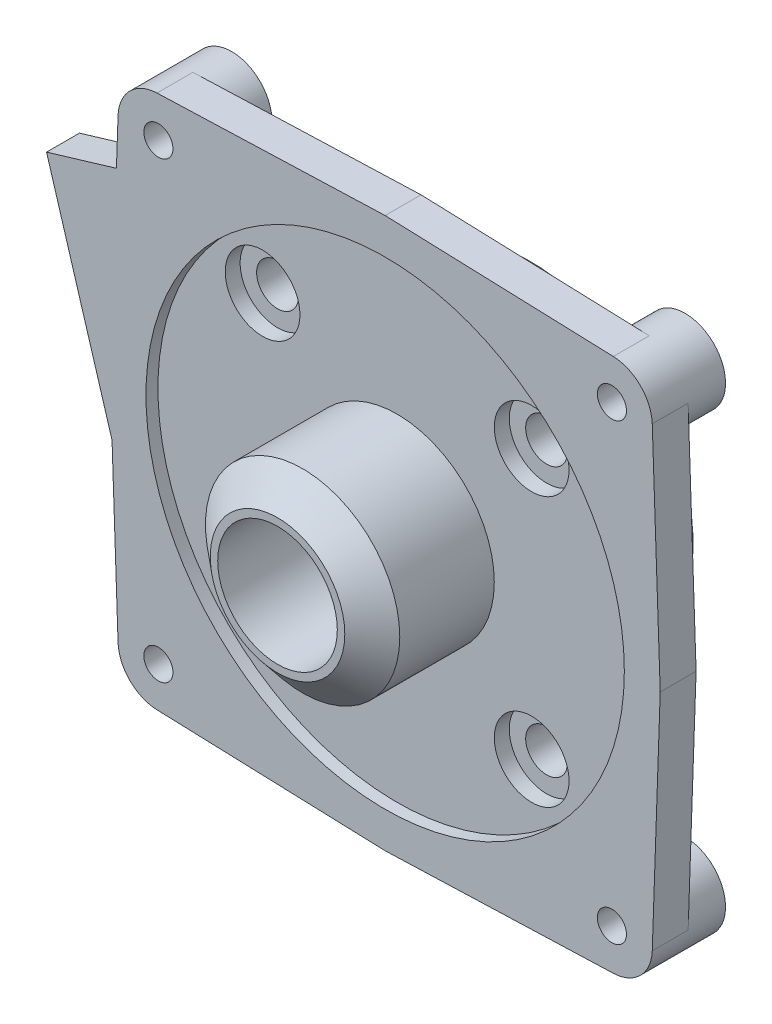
ISO-10303-21;
HEADER;
FILE_DESCRIPTION(('STEP AP214'),'2;1');
FILE_NAME('part.step','',(''),(''),'','','');
FILE_SCHEMA(('AUTOMOTIVE_DESIGN { 1 0 10303 214 1 1 1 1 }'));
ENDSEC;
DATA;
#1=APPLICATION_CONTEXT('core data for automotive mechanical design processes');
#2=APPLICATION_PROTOCOL_DEFINITION('international standard','automotive_design',2000,#1);
#3=PRODUCT_CONTEXT('',#1,'mechanical');
#4=PRODUCT('Part','Part','',(#3));
#5=PRODUCT_RELATED_PRODUCT_CATEGORY('part','',(#4));
#6=PRODUCT_DEFINITION_FORMATION('','',#4);
#7=PRODUCT_DEFINITION_CONTEXT('part definition',#1,'design');
#8=PRODUCT_DEFINITION('design','',#6,#7);
#9=PRODUCT_DEFINITION_SHAPE('','',#8);
#10=(LENGTH_UNIT() NAMED_UNIT(*) SI_UNIT(.MILLI.,.METRE.));
#11=(NAMED_UNIT(*) PLANE_ANGLE_UNIT() SI_UNIT($,.RADIAN.));
#12=(NAMED_UNIT(*) SI_UNIT($,.STERADIAN.) SOLID_ANGLE_UNIT());
#13=UNCERTAINTY_MEASURE_WITH_UNIT(LENGTH_MEASURE(1.E-05),#10,'distance_accuracy_value','');
#14=(GEOMETRIC_REPRESENTATION_CONTEXT(3) GLOBAL_UNCERTAINTY_ASSIGNED_CONTEXT((#13)) GLOBAL_UNIT_ASSIGNED_CONTEXT((#10,
#11,#12)) REPRESENTATION_CONTEXT('',''));
#15=CARTESIAN_POINT('',(0.,0.,0.));
#16=DIRECTION('',(0.,0.,1.));
#17=DIRECTION('',(1.,0.,0.));
#18=AXIS2_PLACEMENT_3D('',#15,#16,#17);
#19=CARTESIAN_POINT('',(11.8715504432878,12.7306792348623,-4.4));
#20=DIRECTION('',(0.,0.,-1.));
#21=DIRECTION('',(-1.,0.,0.));
#22=AXIS2_PLACEMENT_3D('',#19,#20,#21);
#23=PLANE('',#22);
#24=CARTESIAN_POINT('',(9.,9.,-4.40000000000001));
#25=DIRECTION('',(0.,0.,1.));
#26=DIRECTION('',(1.,0.,0.));
#27=AXIS2_PLACEMENT_3D('',#24,#25,#26);
#28=CIRCLE('',#27,1.40000000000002);
#29=CARTESIAN_POINT('',(10.4,9.,-4.40000000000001));
#30=VERTEX_POINT('',#29);
#31=EDGE_CURVE('E1165',#30,#30,#28,.T.);
#32=ORIENTED_EDGE('',*,*,#31,.T.);
#33=EDGE_LOOP('',(#32));
#34=FACE_BOUND('',#33,.T.);
#35=CARTESIAN_POINT('',(9.,-9.,-4.40000000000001));
#36=DIRECTION('',(0.,0.,1.));
#37=DIRECTION('',(1.,0.,0.));
#38=AXIS2_PLACEMENT_3D('',#35,#36,#37);
#39=CIRCLE('',#38,1.40000000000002);
#40=CARTESIAN_POINT('',(10.4,-9.,-4.40000000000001));
#41=VERTEX_POINT('',#40);
#42=EDGE_CURVE('E1141',#41,#41,#39,.T.);
#43=ORIENTED_EDGE('',*,*,#42,.T.);
#44=EDGE_LOOP('',(#43));
#45=FACE_BOUND('',#44,.T.);
#46=DIRECTION('',(-0.999390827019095,0.0348994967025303,0.));
#47=VECTOR('',#46,1.);
#48=CARTESIAN_POINT('',(-11.9005395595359,-11.9005395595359,-4.4));
#49=LINE('',#48,#47);
#50=CARTESIAN_POINT('',(0.,-12.3161155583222,-4.4));
#51=VERTEX_POINT('',#50);
#52=CARTESIAN_POINT('',(-9.10469849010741,-11.9981724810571,-4.4));
#53=VERTEX_POINT('',#52);
#54=EDGE_CURVE('E701',#51,#53,#49,.T.);
#55=ORIENTED_EDGE('',*,*,#54,.T.);
#56=CARTESIAN_POINT('',(-8.99999999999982,-8.99999999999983,-4.4));
#57=DIRECTION('',(0.,0.,-1.));
#58=DIRECTION('',(-1.,0.,0.));
#59=AXIS2_PLACEMENT_3D('',#56,#57,#58);
#60=CIRCLE('',#59,2.99999999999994);
#61=CARTESIAN_POINT('',(-11.9981724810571,-9.10469849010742,-4.4));
#62=VERTEX_POINT('',#61);
#63=EDGE_CURVE('E358',#53,#62,#60,.T.);
#64=ORIENTED_EDGE('',*,*,#63,.T.);
#65=DIRECTION('',(-0.0348994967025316,0.999390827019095,0.));
#66=VECTOR('',#65,1.);
#67=CARTESIAN_POINT('',(-12.3161155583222,0.,-4.4));
#68=LINE('',#67,#66);
#69=CARTESIAN_POINT('',(-12.3161155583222,0.,-4.4));
#70=VERTEX_POINT('',#69);
#71=EDGE_CURVE('E699',#62,#70,#68,.T.);
#72=ORIENTED_EDGE('',*,*,#71,.T.);
#73=DIRECTION('',(0.034899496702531,0.999390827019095,0.));
#74=VECTOR('',#73,1.);
#75=CARTESIAN_POINT('',(-11.9005395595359,11.9005395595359,-4.4));
#76=LINE('',#75,#74);
#77=CARTESIAN_POINT('',(-11.9981724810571,9.10469849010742,-4.4));
#78=VERTEX_POINT('',#77);
#79=EDGE_CURVE('E709',#70,#78,#76,.T.);
#80=ORIENTED_EDGE('',*,*,#79,.T.);
#81=CARTESIAN_POINT('',(-8.99999999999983,8.99999999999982,-4.4));
#82=DIRECTION('',(0.,0.,-1.));
#83=DIRECTION('',(-1.,0.,0.));
#84=AXIS2_PLACEMENT_3D('',#81,#82,#83);
#85=CIRCLE('',#84,2.99999999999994);
#86=CARTESIAN_POINT('',(-9.10469849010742,11.998172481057,-4.4));
#87=VERTEX_POINT('',#86);
#88=EDGE_CURVE('E536',#78,#87,#85,.T.);
#89=ORIENTED_EDGE('',*,*,#88,.T.);
#90=DIRECTION('',(0.999390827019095,0.0348994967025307,0.));
#91=VECTOR('',#90,1.);
#92=CARTESIAN_POINT('',(3.57970871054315E-13,12.3161155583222,-4.4));
#93=LINE('',#92,#91);
#94=CARTESIAN_POINT('',(3.57970871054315E-13,12.3161155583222,-4.4));
#95=VERTEX_POINT('',#94);
#96=EDGE_CURVE('E529',#87,#95,#93,.T.);
#97=ORIENTED_EDGE('',*,*,#96,.T.);
#98=DIRECTION('',(0.999390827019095,-0.0348994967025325,0.));
#99=VECTOR('',#98,1.);
#100=CARTESIAN_POINT('',(11.9005395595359,11.9005395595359,-4.4));
#101=LINE('',#100,#99);
#102=CARTESIAN_POINT('',(9.10469849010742,11.9981724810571,-4.4));
#103=VERTEX_POINT('',#102);
#104=EDGE_CURVE('E532',#95,#103,#101,.T.);
#105=ORIENTED_EDGE('',*,*,#104,.T.);
#106=CARTESIAN_POINT('',(8.99999999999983,8.99999999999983,-4.4));
#107=DIRECTION('',(0.,0.,-1.));
#108=DIRECTION('',(-1.,0.,0.));
#109=AXIS2_PLACEMENT_3D('',#106,#107,#108);
#110=CIRCLE('',#109,2.99999999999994);
#111=CARTESIAN_POINT('',(11.9981724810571,9.10469849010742,-4.4));
#112=VERTEX_POINT('',#111);
#113=EDGE_CURVE('E683',#103,#112,#110,.T.);
#114=ORIENTED_EDGE('',*,*,#113,.T.);
#115=DIRECTION('',(0.0348994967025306,-0.999390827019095,0.));
#116=VECTOR('',#115,1.);
#117=CARTESIAN_POINT('',(12.3161155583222,0.,-4.4));
#118=LINE('',#117,#116);
#119=CARTESIAN_POINT('',(12.3161155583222,0.,-4.4));
#120=VERTEX_POINT('',#119);
#121=EDGE_CURVE('E550',#112,#120,#118,.T.);
#122=ORIENTED_EDGE('',*,*,#121,.T.);
#123=DIRECTION('',(-0.0348994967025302,-0.999390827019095,0.));
#124=VECTOR('',#123,1.);
#125=CARTESIAN_POINT('',(11.9005395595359,-11.9005395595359,-4.4));
#126=LINE('',#125,#124);
#127=CARTESIAN_POINT('',(11.9981724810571,-9.10469849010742,-4.4));
#128=VERTEX_POINT('',#127);
#129=EDGE_CURVE('E964',#120,#128,#126,.T.);
#130=ORIENTED_EDGE('',*,*,#129,.T.);
#131=CARTESIAN_POINT('',(8.99999999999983,-8.99999999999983,-4.4));
#132=DIRECTION('',(0.,0.,-1.));
#133=DIRECTION('',(-1.,0.,0.));
#134=AXIS2_PLACEMENT_3D('',#131,#132,#133);
#135=CIRCLE('',#134,2.99999999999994);
#136=CARTESIAN_POINT('',(9.10469849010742,-11.9981724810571,-4.4));
#137=VERTEX_POINT('',#136);
#138=EDGE_CURVE('E675',#128,#137,#135,.T.);
#139=ORIENTED_EDGE('',*,*,#138,.T.);
#140=DIRECTION('',(-0.999390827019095,-0.0348994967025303,0.));
#141=VECTOR('',#140,1.);
#142=CARTESIAN_POINT('',(0.,-12.3161155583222,-4.4));
#143=LINE('',#142,#141);
#144=EDGE_CURVE('E967',#137,#51,#143,.T.);
#145=ORIENTED_EDGE('',*,*,#144,.T.);
#146=EDGE_LOOP('',(#55,#64,#72,#80,#89,#97,#105,#114,#122,#130,#139,#145));
#147=FACE_BOUND('',#146,.T.);
#148=CARTESIAN_POINT('',(0.,0.,-4.4));
#149=DIRECTION('',(0.,0.,-1.));
#150=DIRECTION('',(-1.,0.,0.));
#151=AXIS2_PLACEMENT_3D('',#148,#149,#150);
#152=CIRCLE('',#151,10.9);
#153=CARTESIAN_POINT('',(-10.9,0.,-4.4));
#154=VERTEX_POINT('',#153);
#155=EDGE_CURVE('E1109',#154,#154,#152,.T.);
#156=ORIENTED_EDGE('',*,*,#155,.F.);
#157=EDGE_LOOP('',(#156));
#158=FACE_BOUND('',#157,.T.);
#159=CARTESIAN_POINT('',(-9.,9.,-4.40000000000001));
#160=DIRECTION('',(0.,0.,1.));
#161=DIRECTION('',(1.,0.,0.));
#162=AXIS2_PLACEMENT_3D('',#159,#160,#161);
#163=CIRCLE('',#162,1.40000000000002);
#164=CARTESIAN_POINT('',(-7.59999999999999,9.,-4.40000000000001));
#165=VERTEX_POINT('',#164);
#166=EDGE_CURVE('E1153',#165,#165,#163,.T.);
#167=ORIENTED_EDGE('',*,*,#166,.T.);
#168=EDGE_LOOP('',(#167));
#169=FACE_BOUND('',#168,.T.);
#170=CARTESIAN_POINT('',(-9.,-9.,-4.40000000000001));
#171=DIRECTION('',(0.,0.,1.));
#172=DIRECTION('',(1.,0.,0.));
#173=AXIS2_PLACEMENT_3D('',#170,#171,#172);
#174=CIRCLE('',#173,1.40000000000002);
#175=CARTESIAN_POINT('',(-7.59999999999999,-9.,-4.40000000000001));
#176=VERTEX_POINT('',#175);
#177=EDGE_CURVE('E1176',#176,#176,#174,.T.);
#178=ORIENTED_EDGE('',*,*,#177,.T.);
#179=EDGE_LOOP('',(#178));
#180=FACE_BOUND('',#179,.T.);
#181=ADVANCED_FACE('F350',(#34,#45,#147,#158,#169,#180),#23,.T.);
#182=CARTESIAN_POINT('',(0.,0.,-0.8));
#183=DIRECTION('',(0.,0.,1.));
#184=DIRECTION('',(1.,0.,0.));
#185=AXIS2_PLACEMENT_3D('',#182,#183,#184);
#186=PLANE('',#185);
#187=CARTESIAN_POINT('',(-9.,-9.,-0.799999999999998));
#188=DIRECTION('',(0.,0.,1.));
#189=DIRECTION('',(1.,0.,0.));
#190=AXIS2_PLACEMENT_3D('',#187,#188,#189);
#191=CIRCLE('',#190,2.50000000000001);
#192=CARTESIAN_POINT('',(-6.49999999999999,-9.,-0.799999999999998));
#193=VERTEX_POINT('',#192);
#194=EDGE_CURVE('E1167',#193,#193,#191,.T.);
#195=ORIENTED_EDGE('',*,*,#194,.F.);
#196=EDGE_LOOP('',(#195));
#197=FACE_BOUND('',#196,.T.);
#198=CARTESIAN_POINT('',(9.,9.,-0.799999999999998));
#199=DIRECTION('',(0.,0.,1.));
#200=DIRECTION('',(1.,0.,0.));
#201=AXIS2_PLACEMENT_3D('',#198,#199,#200);
#202=CIRCLE('',#201,2.50000000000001);
#203=CARTESIAN_POINT('',(11.5,9.,-0.799999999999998));
#204=VERTEX_POINT('',#203);
#205=EDGE_CURVE('E1156',#204,#204,#202,.T.);
#206=ORIENTED_EDGE('',*,*,#205,.F.);
#207=EDGE_LOOP('',(#206));
#208=FACE_BOUND('',#207,.T.);
#209=CARTESIAN_POINT('',(-9.,9.,-0.799999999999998));
#210=DIRECTION('',(0.,0.,1.));
#211=DIRECTION('',(1.,0.,0.));
#212=AXIS2_PLACEMENT_3D('',#209,#210,#211);
#213=CIRCLE('',#212,2.50000000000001);
#214=CARTESIAN_POINT('',(-6.49999999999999,9.,-0.799999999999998));
#215=VERTEX_POINT('',#214);
#216=EDGE_CURVE('E1144',#215,#215,#213,.T.);
#217=ORIENTED_EDGE('',*,*,#216,.F.);
#218=EDGE_LOOP('',(#217));
#219=FACE_BOUND('',#218,.T.);
#220=CARTESIAN_POINT('',(9.,-9.,-0.799999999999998));
#221=DIRECTION('',(0.,0.,1.));
#222=DIRECTION('',(1.,0.,0.));
#223=AXIS2_PLACEMENT_3D('',#220,#221,#222);
#224=CIRCLE('',#223,2.50000000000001);
#225=CARTESIAN_POINT('',(11.5,-9.,-0.799999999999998));
#226=VERTEX_POINT('',#225);
#227=EDGE_CURVE('E1132',#226,#226,#224,.T.);
#228=ORIENTED_EDGE('',*,*,#227,.F.);
#229=EDGE_LOOP('',(#228));
#230=FACE_BOUND('',#229,.T.);
#231=CARTESIAN_POINT('',(0.,0.,-0.8));
#232=DIRECTION('',(0.,0.,1.));
#233=DIRECTION('',(1.,0.,0.));
#234=AXIS2_PLACEMENT_3D('',#231,#232,#233);
#235=CIRCLE('',#234,16.0000000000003);
#236=CARTESIAN_POINT('',(16.0000000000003,0.,-0.8));
#237=VERTEX_POINT('',#236);
#238=EDGE_CURVE('E943',#237,#237,#235,.T.);
#239=ORIENTED_EDGE('',*,*,#238,.T.);
#240=EDGE_LOOP('',(#239));
#241=FACE_BOUND('',#240,.T.);
#242=CARTESIAN_POINT('',(0.,0.,-0.8));
#243=DIRECTION('',(0.,0.,1.));
#244=DIRECTION('',(1.,0.,0.));
#245=AXIS2_PLACEMENT_3D('',#242,#243,#244);
#246=CIRCLE('',#245,6.5);
#247=CARTESIAN_POINT('',(6.5,0.,-0.8));
#248=VERTEX_POINT('',#247);
#249=EDGE_CURVE('E1103',#248,#248,#246,.T.);
#250=ORIENTED_EDGE('',*,*,#249,.F.);
#251=EDGE_LOOP('',(#250));
#252=FACE_BOUND('',#251,.T.);
#253=ADVANCED_FACE('F722',(#197,#208,#219,#230,#241,#252),#186,.T.);
#254=CARTESIAN_POINT('',(-15.1686531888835,15.1686531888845,-2.4));
#255=DIRECTION('',(0.,0.,1.));
#256=DIRECTION('',(1.,0.,0.));
#257=AXIS2_PLACEMENT_3D('',#254,#255,#256);
#258=PLANE('',#257);
#259=CARTESIAN_POINT('',(-15.168653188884,15.168653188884,-2.4));
#260=DIRECTION('',(0.,0.,-1.));
#261=DIRECTION('',(-1.,0.,0.));
#262=AXIS2_PLACEMENT_3D('',#259,#260,#261);
#263=CIRCLE('',#262,2.70000000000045);
#264=CARTESIAN_POINT('',(-15.2628818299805,17.867008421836,-2.4));
#265=VERTEX_POINT('',#264);
#266=CARTESIAN_POINT('',(-17.8670084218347,15.2628818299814,-2.4));
#267=VERTEX_POINT('',#266);
#268=EDGE_CURVE('E556',#265,#267,#263,.T.);
#269=ORIENTED_EDGE('',*,*,#268,.F.);
#270=DIRECTION('',(0.999390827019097,0.0348994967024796,0.));
#271=VECTOR('',#270,1.);
#272=CARTESIAN_POINT('',(0.,18.4,-2.4));
#273=LINE('',#272,#271);
#274=CARTESIAN_POINT('',(0.,18.4,-2.4));
#275=VERTEX_POINT('',#274);
#276=EDGE_CURVE('E585',#265,#275,#273,.T.);
#277=ORIENTED_EDGE('',*,*,#276,.T.);
#278=DIRECTION('',(0.999390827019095,-0.0348994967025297,0.));
#279=VECTOR('',#278,1.);
#280=CARTESIAN_POINT('',(15.2628818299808,17.867008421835,-2.4));
#281=LINE('',#280,#279);
#282=CARTESIAN_POINT('',(15.2628818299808,17.867008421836,-2.4));
#283=VERTEX_POINT('',#282);
#284=EDGE_CURVE('E588',#275,#283,#281,.T.);
#285=ORIENTED_EDGE('',*,*,#284,.T.);
#286=CARTESIAN_POINT('',(15.168653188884,15.168653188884,-2.4));
#287=DIRECTION('',(0.,0.,-1.));
#288=DIRECTION('',(-1.,0.,0.));
#289=AXIS2_PLACEMENT_3D('',#286,#287,#288);
#290=CIRCLE('',#289,2.70000000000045);
#291=CARTESIAN_POINT('',(17.8670084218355,15.2628818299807,-2.4));
#292=VERTEX_POINT('',#291);
#293=EDGE_CURVE('E623',#292,#283,#290,.T.);
#294=ORIENTED_EDGE('',*,*,#293,.F.);
#295=DIRECTION('',(0.0348994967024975,-0.999390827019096,0.));
#296=VECTOR('',#295,1.);
#297=CARTESIAN_POINT('',(18.4,0.,-2.4));
#298=LINE('',#297,#296);
#299=CARTESIAN_POINT('',(18.4,0.,-2.4));
#300=VERTEX_POINT('',#299);
#301=EDGE_CURVE('E593',#292,#300,#298,.T.);
#302=ORIENTED_EDGE('',*,*,#301,.T.);
#303=DIRECTION('',(-0.0348994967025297,-0.999390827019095,0.));
#304=VECTOR('',#303,1.);
#305=CARTESIAN_POINT('',(17.867008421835,-15.2628818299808,-2.4));
#306=LINE('',#305,#304);
#307=CARTESIAN_POINT('',(17.8670084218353,-15.2628818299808,-2.4));
#308=VERTEX_POINT('',#307);
#309=EDGE_CURVE('E589',#300,#308,#306,.T.);
#310=ORIENTED_EDGE('',*,*,#309,.T.);
#311=CARTESIAN_POINT('',(15.168653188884,-15.168653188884,-2.4));
#312=DIRECTION('',(0.,0.,-1.));
#313=DIRECTION('',(-1.,0.,0.));
#314=AXIS2_PLACEMENT_3D('',#311,#312,#313);
#315=CIRCLE('',#314,2.70000000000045);
#316=CARTESIAN_POINT('',(15.2628818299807,-17.867008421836,-2.4));
#317=VERTEX_POINT('',#316);
#318=EDGE_CURVE('E575',#317,#308,#315,.T.);
#319=ORIENTED_EDGE('',*,*,#318,.F.);
#320=DIRECTION('',(-0.999390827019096,-0.0348994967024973,0.));
#321=VECTOR('',#320,1.);
#322=CARTESIAN_POINT('',(0.,-18.4,-2.4));
#323=LINE('',#322,#321);
#324=CARTESIAN_POINT('',(0.,-18.4,-2.4));
#325=VERTEX_POINT('',#324);
#326=EDGE_CURVE('E592',#317,#325,#323,.T.);
#327=ORIENTED_EDGE('',*,*,#326,.T.);
#328=DIRECTION('',(-0.999390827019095,0.0348994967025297,0.));
#329=VECTOR('',#328,1.);
#330=CARTESIAN_POINT('',(-15.2628818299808,-17.867008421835,-2.4));
#331=LINE('',#330,#329);
#332=CARTESIAN_POINT('',(-15.2628818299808,-17.8670084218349,-2.4));
#333=VERTEX_POINT('',#332);
#334=EDGE_CURVE('E596',#325,#333,#331,.T.);
#335=ORIENTED_EDGE('',*,*,#334,.T.);
#336=CARTESIAN_POINT('',(-15.168653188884,-15.168653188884,-2.4));
#337=DIRECTION('',(0.,0.,-1.));
#338=DIRECTION('',(-1.,0.,0.));
#339=AXIS2_PLACEMENT_3D('',#336,#337,#338);
#340=CIRCLE('',#339,2.70000000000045);
#341=CARTESIAN_POINT('',(-17.867008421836,-15.2628818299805,-2.4));
#342=VERTEX_POINT('',#341);
#343=EDGE_CURVE('E569',#342,#333,#340,.T.);
#344=ORIENTED_EDGE('',*,*,#343,.F.);
#345=DIRECTION('',(-0.0348994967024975,0.999390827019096,0.));
#346=VECTOR('',#345,1.);
#347=CARTESIAN_POINT('',(-18.3999999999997,5.18309972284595E-13,-2.4));
#348=LINE('',#347,#346);
#349=CARTESIAN_POINT('',(-18.3999999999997,5.18309972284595E-13,-2.4));
#350=VERTEX_POINT('',#349);
#351=EDGE_CURVE('E599',#342,#350,#348,.T.);
#352=ORIENTED_EDGE('',*,*,#351,.T.);
#353=DIRECTION('',(0.0348994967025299,0.999390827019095,0.));
#354=VECTOR('',#353,1.);
#355=CARTESIAN_POINT('',(-17.8670084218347,15.2628818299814,-2.4));
#356=LINE('',#355,#354);
#357=EDGE_CURVE('E601',#350,#267,#356,.T.);
#358=ORIENTED_EDGE('',*,*,#357,.T.);
#359=EDGE_LOOP('',(#269,#277,#285,#294,#302,#310,#319,#327,#335,#344,#352,#358));
#360=FACE_BOUND('',#359,.T.);
#361=DIRECTION('',(0.999390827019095,0.0348994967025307,0.));
#362=VECTOR('',#361,1.);
#363=CARTESIAN_POINT('',(3.57970871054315E-13,12.3161155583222,-2.4));
#364=LINE('',#363,#362);
#365=CARTESIAN_POINT('',(-9.10469849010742,11.998172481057,-2.4));
#366=VERTEX_POINT('',#365);
#367=CARTESIAN_POINT('',(3.57353036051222E-13,12.3161155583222,-2.4));
#368=VERTEX_POINT('',#367);
#369=EDGE_CURVE('E554',#366,#368,#364,.T.);
#370=ORIENTED_EDGE('',*,*,#369,.F.);
#371=CARTESIAN_POINT('',(-8.99999999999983,8.99999999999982,-2.4));
#372=DIRECTION('',(0.,0.,1.));
#373=DIRECTION('',(1.,0.,0.));
#374=AXIS2_PLACEMENT_3D('',#371,#372,#373);
#375=CIRCLE('',#374,2.99999999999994);
#376=CARTESIAN_POINT('',(-11.9981724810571,9.10469849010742,-2.4));
#377=VERTEX_POINT('',#376);
#378=EDGE_CURVE('E692',#366,#377,#375,.T.);
#379=ORIENTED_EDGE('',*,*,#378,.T.);
#380=DIRECTION('',(0.034899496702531,0.999390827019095,0.));
#381=VECTOR('',#380,1.);
#382=CARTESIAN_POINT('',(-11.9005395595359,11.9005395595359,-2.4));
#383=LINE('',#382,#381);
#384=CARTESIAN_POINT('',(-12.3161155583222,0.,-2.4));
#385=VERTEX_POINT('',#384);
#386=EDGE_CURVE('E541',#385,#377,#383,.T.);
#387=ORIENTED_EDGE('',*,*,#386,.F.);
#388=DIRECTION('',(-0.0348994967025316,0.999390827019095,0.));
#389=VECTOR('',#388,1.);
#390=CARTESIAN_POINT('',(-12.3161155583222,0.,-2.4));
#391=LINE('',#390,#389);
#392=CARTESIAN_POINT('',(-11.9981724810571,-9.10469849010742,-2.4));
#393=VERTEX_POINT('',#392);
#394=EDGE_CURVE('E960',#393,#385,#391,.T.);
#395=ORIENTED_EDGE('',*,*,#394,.F.);
#396=CARTESIAN_POINT('',(-8.99999999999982,-8.99999999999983,-2.4));
#397=DIRECTION('',(0.,0.,1.));
#398=DIRECTION('',(1.,0.,0.));
#399=AXIS2_PLACEMENT_3D('',#396,#397,#398);
#400=CIRCLE('',#399,2.99999999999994);
#401=CARTESIAN_POINT('',(-9.10469849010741,-11.9981724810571,-2.4));
#402=VERTEX_POINT('',#401);
#403=EDGE_CURVE('E11',#393,#402,#400,.T.);
#404=ORIENTED_EDGE('',*,*,#403,.T.);
#405=DIRECTION('',(-0.999390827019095,0.0348994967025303,0.));
#406=VECTOR('',#405,1.);
#407=CARTESIAN_POINT('',(-11.9005395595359,-11.9005395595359,-2.4));
#408=LINE('',#407,#406);
#409=CARTESIAN_POINT('',(0.,-12.3161155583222,-2.4));
#410=VERTEX_POINT('',#409);
#411=EDGE_CURVE('E958',#410,#402,#408,.T.);
#412=ORIENTED_EDGE('',*,*,#411,.F.);
#413=DIRECTION('',(-0.999390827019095,-0.0348994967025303,0.));
#414=VECTOR('',#413,1.);
#415=CARTESIAN_POINT('',(0.,-12.3161155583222,-2.4));
#416=LINE('',#415,#414);
#417=CARTESIAN_POINT('',(9.10469849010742,-11.9981724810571,-2.4));
#418=VERTEX_POINT('',#417);
#419=EDGE_CURVE('E956',#418,#410,#416,.T.);
#420=ORIENTED_EDGE('',*,*,#419,.F.);
#421=CARTESIAN_POINT('',(8.99999999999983,-8.99999999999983,-2.4));
#422=DIRECTION('',(0.,0.,1.));
#423=DIRECTION('',(1.,0.,0.));
#424=AXIS2_PLACEMENT_3D('',#421,#422,#423);
#425=CIRCLE('',#424,2.99999999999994);
#426=CARTESIAN_POINT('',(11.9981724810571,-9.10469849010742,-2.4));
#427=VERTEX_POINT('',#426);
#428=EDGE_CURVE('E677',#418,#427,#425,.T.);
#429=ORIENTED_EDGE('',*,*,#428,.T.);
#430=DIRECTION('',(-0.0348994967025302,-0.999390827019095,0.));
#431=VECTOR('',#430,1.);
#432=CARTESIAN_POINT('',(11.9005395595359,-11.9005395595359,-2.4));
#433=LINE('',#432,#431);
#434=CARTESIAN_POINT('',(12.3161155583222,0.,-2.4));
#435=VERTEX_POINT('',#434);
#436=EDGE_CURVE('E953',#435,#427,#433,.T.);
#437=ORIENTED_EDGE('',*,*,#436,.F.);
#438=DIRECTION('',(0.0348994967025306,-0.999390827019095,0.));
#439=VECTOR('',#438,1.);
#440=CARTESIAN_POINT('',(12.3161155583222,0.,-2.4));
#441=LINE('',#440,#439);
#442=CARTESIAN_POINT('',(11.9981724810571,9.10469849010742,-2.4));
#443=VERTEX_POINT('',#442);
#444=EDGE_CURVE('E945',#443,#435,#441,.T.);
#445=ORIENTED_EDGE('',*,*,#444,.F.);
#446=CARTESIAN_POINT('',(8.99999999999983,8.99999999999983,-2.4));
#447=DIRECTION('',(0.,0.,1.));
#448=DIRECTION('',(1.,0.,0.));
#449=AXIS2_PLACEMENT_3D('',#446,#447,#448);
#450=CIRCLE('',#449,2.99999999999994);
#451=CARTESIAN_POINT('',(9.10469849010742,11.9981724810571,-2.4));
#452=VERTEX_POINT('',#451);
#453=EDGE_CURVE('E685',#443,#452,#450,.T.);
#454=ORIENTED_EDGE('',*,*,#453,.T.);
#455=DIRECTION('',(0.999390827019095,-0.0348994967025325,0.));
#456=VECTOR('',#455,1.);
#457=CARTESIAN_POINT('',(11.9005395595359,11.9005395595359,-2.4));
#458=LINE('',#457,#456);
#459=EDGE_CURVE('E942',#368,#452,#458,.T.);
#460=ORIENTED_EDGE('',*,*,#459,.F.);
#461=EDGE_LOOP('',(#370,#379,#387,#395,#404,#412,#420,#429,#437,#445,#454,#460));
#462=FACE_BOUND('',#461,.T.);
#463=ADVANCED_FACE('F730',(#360,#462),#258,.F.);
#464=CARTESIAN_POINT('',(-18.2690471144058,-3.75000000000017,0.));
#465=DIRECTION('',(-0.957262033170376,-0.289222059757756,0.));
#466=DIRECTION('',(0.289222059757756,-0.957262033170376,0.));
#467=AXIS2_PLACEMENT_3D('',#464,#465,#466);
#468=PLANE('',#467);
#469=DIRECTION('',(-0.289222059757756,0.957262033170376,0.));
#470=VECTOR('',#469,1.);
#471=CARTESIAN_POINT('',(-18.2690471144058,-3.75000000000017,-2.20000000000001));
#472=LINE('',#471,#470);
#473=CARTESIAN_POINT('',(-18.2690471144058,-3.75000000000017,-2.20000000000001));
#474=VERTEX_POINT('',#473);
#475=CARTESIAN_POINT('',(-22.65,10.75,-2.19999999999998));
#476=VERTEX_POINT('',#475);
#477=EDGE_CURVE('E607',#474,#476,#472,.T.);
#478=ORIENTED_EDGE('',*,*,#477,.F.);
#479=DIRECTION('',(0.,0.,-1.));
#480=VECTOR('',#479,1.);
#481=CARTESIAN_POINT('',(-18.2690471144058,-3.75000000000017,0.));
#482=LINE('',#481,#480);
#483=CARTESIAN_POINT('',(-18.2690471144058,-3.75000000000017,0.));
#484=VERTEX_POINT('',#483);
#485=EDGE_CURVE('E624',#484,#474,#482,.T.);
#486=ORIENTED_EDGE('',*,*,#485,.F.);
#487=DIRECTION('',(-0.289222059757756,0.957262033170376,0.));
#488=VECTOR('',#487,1.);
#489=CARTESIAN_POINT('',(-18.2690471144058,-3.75000000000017,0.));
#490=LINE('',#489,#488);
#491=CARTESIAN_POINT('',(-22.65,10.75,0.));
#492=VERTEX_POINT('',#491);
#493=EDGE_CURVE('E611',#484,#492,#490,.T.);
#494=ORIENTED_EDGE('',*,*,#493,.T.);
#495=DIRECTION('',(0.,0.,-1.));
#496=VECTOR('',#495,1.);
#497=CARTESIAN_POINT('',(-22.65,10.75,0.));
#498=LINE('',#497,#496);
#499=EDGE_CURVE('E616',#492,#476,#498,.T.);
#500=ORIENTED_EDGE('',*,*,#499,.T.);
#501=EDGE_LOOP('',(#478,#486,#494,#500));
#502=FACE_BOUND('',#501,.T.);
#503=ADVANCED_FACE('F352',(#502),#468,.T.);
#504=CARTESIAN_POINT('',(-17.867008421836,-15.2628818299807,0.));
#505=DIRECTION('',(-0.999390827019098,-0.0348994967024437,0.));
#506=DIRECTION('',(0.0348994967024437,-0.999390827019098,0.));
#507=AXIS2_PLACEMENT_3D('',#504,#505,#506);
#508=PLANE('',#507);
#509=ORIENTED_EDGE('',*,*,#485,.T.);
#510=DIRECTION('',(-0.0348994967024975,0.999390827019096,0.));
#511=VECTOR('',#510,1.);
#512=CARTESIAN_POINT('',(-18.3999999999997,5.18309972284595E-13,-2.2));
#513=LINE('',#512,#511);
#514=CARTESIAN_POINT('',(-18.3999999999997,5.18309972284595E-13,-2.2));
#515=VERTEX_POINT('',#514);
#516=EDGE_CURVE('E620',#474,#515,#513,.T.);
#517=ORIENTED_EDGE('',*,*,#516,.T.);
#518=DIRECTION('',(0.,0.,1.));
#519=VECTOR('',#518,1.);
#520=CARTESIAN_POINT('',(-18.3999999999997,5.18309972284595E-13,-2.4));
#521=LINE('',#520,#519);
#522=EDGE_CURVE('E604',#350,#515,#521,.T.);
#523=ORIENTED_EDGE('',*,*,#522,.F.);
#524=ORIENTED_EDGE('',*,*,#351,.F.);
#525=DIRECTION('',(0.,0.,-1.));
#526=VECTOR('',#525,1.);
#527=CARTESIAN_POINT('',(-17.8670084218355,-15.2628818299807,0.));
#528=LINE('',#527,#526);
#529=CARTESIAN_POINT('',(-17.8670084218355,-15.2628818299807,0.));
#530=VERTEX_POINT('',#529);
#531=EDGE_CURVE('E627',#530,#342,#528,.T.);
#532=ORIENTED_EDGE('',*,*,#531,.F.);
#533=DIRECTION('',(-0.0348994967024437,0.999390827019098,0.));
#534=VECTOR('',#533,1.);
#535=CARTESIAN_POINT('',(-17.867008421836,-15.2628818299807,0.));
#536=LINE('',#535,#534);
#537=EDGE_CURVE('E850',#530,#484,#536,.T.);
#538=ORIENTED_EDGE('',*,*,#537,.T.);
#539=EDGE_LOOP('',(#509,#517,#523,#524,#532,#538));
#540=FACE_BOUND('',#539,.T.);
#541=ADVANCED_FACE('F791',(#540),#508,.T.);
#542=CARTESIAN_POINT('',(-15.168653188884,-15.168653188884,0.));
#543=DIRECTION('',(0.,0.,-1.));
#544=DIRECTION('',(-1.,0.,0.));
#545=AXIS2_PLACEMENT_3D('',#542,#543,#544);
#546=CYLINDRICAL_SURFACE('',#545,2.69999999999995);
#547=ORIENTED_EDGE('',*,*,#531,.T.);
#548=ORIENTED_EDGE('',*,*,#343,.T.);
#549=DIRECTION('',(0.,0.,-1.));
#550=VECTOR('',#549,1.);
#551=CARTESIAN_POINT('',(-15.2628818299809,-17.867008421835,0.));
#552=LINE('',#551,#550);
#553=CARTESIAN_POINT('',(-15.2628818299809,-17.867008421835,0.));
#554=VERTEX_POINT('',#553);
#555=EDGE_CURVE('E862',#554,#333,#552,.T.);
#556=ORIENTED_EDGE('',*,*,#555,.F.);
#557=CARTESIAN_POINT('',(-15.168653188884,-15.168653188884,0.));
#558=DIRECTION('',(0.,0.,-1.));
#559=DIRECTION('',(-1.,0.,0.));
#560=AXIS2_PLACEMENT_3D('',#557,#558,#559);
#561=CIRCLE('',#560,2.69999999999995);
#562=EDGE_CURVE('E852',#554,#530,#561,.T.);
#563=ORIENTED_EDGE('',*,*,#562,.T.);
#564=EDGE_LOOP('',(#547,#548,#556,#563));
#565=FACE_BOUND('',#564,.T.);
#566=CARTESIAN_POINT('',(-15.168653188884,-15.168653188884,-4.89999999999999));
#567=DIRECTION('',(0.,0.,-1.));
#568=DIRECTION('',(-1.,0.,0.));
#569=AXIS2_PLACEMENT_3D('',#566,#567,#568);
#570=CIRCLE('',#569,2.70000000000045);
#571=CARTESIAN_POINT('',(-17.8686531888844,-15.168653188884,-4.89999999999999));
#572=VERTEX_POINT('',#571);
#573=EDGE_CURVE('E572',#572,#572,#570,.T.);
#574=ORIENTED_EDGE('',*,*,#573,.F.);
#575=EDGE_LOOP('',(#574));
#576=FACE_BOUND('',#575,.T.);
#577=ADVANCED_FACE('F794',(#565,#576),#546,.T.);
#578=CARTESIAN_POINT('',(0.,-18.4,0.));
#579=DIRECTION('',(-0.03489949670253,-0.999390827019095,0.));
#580=DIRECTION('',(0.999390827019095,-0.03489949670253,0.));
#581=AXIS2_PLACEMENT_3D('',#578,#579,#580);
#582=PLANE('',#581);
#583=ORIENTED_EDGE('',*,*,#555,.T.);
#584=ORIENTED_EDGE('',*,*,#334,.F.);
#585=DIRECTION('',(0.,0.,-1.));
#586=VECTOR('',#585,1.);
#587=CARTESIAN_POINT('',(0.,-18.4,0.));
#588=LINE('',#587,#586);
#589=CARTESIAN_POINT('',(0.,-18.4,0.));
#590=VERTEX_POINT('',#589);
#591=EDGE_CURVE('E864',#590,#325,#588,.T.);
#592=ORIENTED_EDGE('',*,*,#591,.F.);
#593=DIRECTION('',(-0.999390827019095,0.03489949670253,0.));
#594=VECTOR('',#593,1.);
#595=CARTESIAN_POINT('',(0.,-18.4,0.));
#596=LINE('',#595,#594);
#597=EDGE_CURVE('E856',#590,#554,#596,.T.);
#598=ORIENTED_EDGE('',*,*,#597,.T.);
#599=EDGE_LOOP('',(#583,#584,#592,#598));
#600=FACE_BOUND('',#599,.T.);
#601=ADVANCED_FACE('F798',(#600),#582,.T.);
#602=CARTESIAN_POINT('',(15.2628818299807,-17.867008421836,0.));
#603=DIRECTION('',(0.0348994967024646,-0.999390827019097,0.));
#604=DIRECTION('',(0.999390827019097,0.0348994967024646,0.));
#605=AXIS2_PLACEMENT_3D('',#602,#603,#604);
#606=PLANE('',#605);
#607=ORIENTED_EDGE('',*,*,#591,.T.);
#608=ORIENTED_EDGE('',*,*,#326,.F.);
#609=DIRECTION('',(0.,0.,-1.));
#610=VECTOR('',#609,1.);
#611=CARTESIAN_POINT('',(15.2628818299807,-17.8670084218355,0.));
#612=LINE('',#611,#610);
#613=CARTESIAN_POINT('',(15.2628818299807,-17.8670084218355,0.));
#614=VERTEX_POINT('',#613);
#615=EDGE_CURVE('E866',#614,#317,#612,.T.);
#616=ORIENTED_EDGE('',*,*,#615,.F.);
#617=DIRECTION('',(-0.999390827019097,-0.0348994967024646,0.));
#618=VECTOR('',#617,1.);
#619=CARTESIAN_POINT('',(15.2628818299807,-17.867008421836,0.));
#620=LINE('',#619,#618);
#621=EDGE_CURVE('E912',#614,#590,#620,.T.);
#622=ORIENTED_EDGE('',*,*,#621,.T.);
#623=EDGE_LOOP('',(#607,#608,#616,#622));
#624=FACE_BOUND('',#623,.T.);
#625=ADVANCED_FACE('F802',(#624),#606,.T.);
#626=CARTESIAN_POINT('',(15.168653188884,-15.168653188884,0.));
#627=DIRECTION('',(0.,0.,-1.));
#628=DIRECTION('',(-1.,0.,0.));
#629=AXIS2_PLACEMENT_3D('',#626,#627,#628);
#630=CYLINDRICAL_SURFACE('',#629,2.69999999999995);
#631=ORIENTED_EDGE('',*,*,#615,.T.);
#632=ORIENTED_EDGE('',*,*,#318,.T.);
#633=DIRECTION('',(0.,0.,-1.));
#634=VECTOR('',#633,1.);
#635=CARTESIAN_POINT('',(17.867008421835,-15.2628818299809,0.));
#636=LINE('',#635,#634);
#637=CARTESIAN_POINT('',(17.867008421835,-15.2628818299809,0.));
#638=VERTEX_POINT('',#637);
#639=EDGE_CURVE('E869',#638,#308,#636,.T.);
#640=ORIENTED_EDGE('',*,*,#639,.F.);
#641=CARTESIAN_POINT('',(15.168653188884,-15.168653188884,0.));
#642=DIRECTION('',(0.,0.,-1.));
#643=DIRECTION('',(-1.,0.,0.));
#644=AXIS2_PLACEMENT_3D('',#641,#642,#643);
#645=CIRCLE('',#644,2.69999999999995);
#646=EDGE_CURVE('E909',#638,#614,#645,.T.);
#647=ORIENTED_EDGE('',*,*,#646,.T.);
#648=EDGE_LOOP('',(#631,#632,#640,#647));
#649=FACE_BOUND('',#648,.T.);
#650=CARTESIAN_POINT('',(15.168653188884,-15.168653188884,-4.89999999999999));
#651=DIRECTION('',(0.,0.,-1.));
#652=DIRECTION('',(-1.,0.,0.));
#653=AXIS2_PLACEMENT_3D('',#650,#651,#652);
#654=CIRCLE('',#653,2.70000000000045);
#655=CARTESIAN_POINT('',(12.4686531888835,-15.168653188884,-4.89999999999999));
#656=VERTEX_POINT('',#655);
#657=EDGE_CURVE('E578',#656,#656,#654,.T.);
#658=ORIENTED_EDGE('',*,*,#657,.F.);
#659=EDGE_LOOP('',(#658));
#660=FACE_BOUND('',#659,.T.);
#661=ADVANCED_FACE('F806',(#649,#660),#630,.T.);
#662=CARTESIAN_POINT('',(18.4,0.,0.));
#663=DIRECTION('',(0.999390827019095,-0.03489949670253,0.));
#664=DIRECTION('',(0.03489949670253,0.999390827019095,0.));
#665=AXIS2_PLACEMENT_3D('',#662,#663,#664);
#666=PLANE('',#665);
#667=ORIENTED_EDGE('',*,*,#639,.T.);
#668=ORIENTED_EDGE('',*,*,#309,.F.);
#669=DIRECTION('',(0.,0.,-1.));
#670=VECTOR('',#669,1.);
#671=CARTESIAN_POINT('',(18.4,0.,0.));
#672=LINE('',#671,#670);
#673=CARTESIAN_POINT('',(18.4,0.,0.));
#674=VERTEX_POINT('',#673);
#675=EDGE_CURVE('E657',#674,#300,#672,.T.);
#676=ORIENTED_EDGE('',*,*,#675,.F.);
#677=DIRECTION('',(-0.03489949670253,-0.999390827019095,0.));
#678=VECTOR('',#677,1.);
#679=CARTESIAN_POINT('',(18.4,0.,0.));
#680=LINE('',#679,#678);
#681=EDGE_CURVE('E906',#674,#638,#680,.T.);
#682=ORIENTED_EDGE('',*,*,#681,.T.);
#683=EDGE_LOOP('',(#667,#668,#676,#682));
#684=FACE_BOUND('',#683,.T.);
#685=ADVANCED_FACE('F810',(#684),#666,.T.);
#686=CARTESIAN_POINT('',(17.867008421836,15.2628818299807,0.));
#687=DIRECTION('',(0.999390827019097,0.0348994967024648,0.));
#688=DIRECTION('',(-0.0348994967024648,0.999390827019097,0.));
#689=AXIS2_PLACEMENT_3D('',#686,#687,#688);
#690=PLANE('',#689);
#691=ORIENTED_EDGE('',*,*,#675,.T.);
#692=ORIENTED_EDGE('',*,*,#301,.F.);
#693=DIRECTION('',(0.,0.,-1.));
#694=VECTOR('',#693,1.);
#695=CARTESIAN_POINT('',(17.8670084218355,15.2628818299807,0.));
#696=LINE('',#695,#694);
#697=CARTESIAN_POINT('',(17.8670084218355,15.2628818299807,0.));
#698=VERTEX_POINT('',#697);
#699=EDGE_CURVE('E654',#698,#292,#696,.T.);
#700=ORIENTED_EDGE('',*,*,#699,.F.);
#701=DIRECTION('',(0.0348994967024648,-0.999390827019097,0.));
#702=VECTOR('',#701,1.);
#703=CARTESIAN_POINT('',(17.867008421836,15.2628818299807,0.));
#704=LINE('',#703,#702);
#705=EDGE_CURVE('E903',#698,#674,#704,.T.);
#706=ORIENTED_EDGE('',*,*,#705,.T.);
#707=EDGE_LOOP('',(#691,#692,#700,#706));
#708=FACE_BOUND('',#707,.T.);
#709=ADVANCED_FACE('F814',(#708),#690,.T.);
#710=CARTESIAN_POINT('',(15.168653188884,15.168653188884,0.));
#711=DIRECTION('',(0.,0.,-1.));
#712=DIRECTION('',(-1.,0.,0.));
#713=AXIS2_PLACEMENT_3D('',#710,#711,#712);
#714=CYLINDRICAL_SURFACE('',#713,2.69999999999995);
#715=ORIENTED_EDGE('',*,*,#699,.T.);
#716=ORIENTED_EDGE('',*,*,#293,.T.);
#717=DIRECTION('',(0.,0.,-1.));
#718=VECTOR('',#717,1.);
#719=CARTESIAN_POINT('',(15.2628818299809,17.867008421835,0.));
#720=LINE('',#719,#718);
#721=CARTESIAN_POINT('',(15.2628818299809,17.867008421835,0.));
#722=VERTEX_POINT('',#721);
#723=EDGE_CURVE('E658',#722,#283,#720,.T.);
#724=ORIENTED_EDGE('',*,*,#723,.F.);
#725=CARTESIAN_POINT('',(15.168653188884,15.168653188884,0.));
#726=DIRECTION('',(0.,0.,-1.));
#727=DIRECTION('',(-1.,0.,0.));
#728=AXIS2_PLACEMENT_3D('',#725,#726,#727);
#729=CIRCLE('',#728,2.69999999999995);
#730=EDGE_CURVE('E896',#722,#698,#729,.T.);
#731=ORIENTED_EDGE('',*,*,#730,.T.);
#732=EDGE_LOOP('',(#715,#716,#724,#731));
#733=FACE_BOUND('',#732,.T.);
#734=CARTESIAN_POINT('',(15.168653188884,15.168653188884,-4.89999999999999));
#735=DIRECTION('',(0.,0.,-1.));
#736=DIRECTION('',(-1.,0.,0.));
#737=AXIS2_PLACEMENT_3D('',#734,#735,#736);
#738=CIRCLE('',#737,2.70000000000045);
#739=CARTESIAN_POINT('',(12.4686531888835,15.168653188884,-4.89999999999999));
#740=VERTEX_POINT('',#739);
#741=EDGE_CURVE('E581',#740,#740,#738,.T.);
#742=ORIENTED_EDGE('',*,*,#741,.F.);
#743=EDGE_LOOP('',(#742));
#744=FACE_BOUND('',#743,.T.);
#745=ADVANCED_FACE('F818',(#733,#744),#714,.T.);
#746=CARTESIAN_POINT('',(0.,18.4,0.));
#747=DIRECTION('',(0.03489949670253,0.999390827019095,0.));
#748=DIRECTION('',(-0.999390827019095,0.03489949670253,0.));
#749=AXIS2_PLACEMENT_3D('',#746,#747,#748);
#750=PLANE('',#749);
#751=ORIENTED_EDGE('',*,*,#723,.T.);
#752=ORIENTED_EDGE('',*,*,#284,.F.);
#753=DIRECTION('',(0.,0.,-1.));
#754=VECTOR('',#753,1.);
#755=CARTESIAN_POINT('',(0.,18.4,0.));
#756=LINE('',#755,#754);
#757=CARTESIAN_POINT('',(0.,18.4,0.));
#758=VERTEX_POINT('',#757);
#759=EDGE_CURVE('E872',#758,#275,#756,.T.);
#760=ORIENTED_EDGE('',*,*,#759,.F.);
#761=DIRECTION('',(0.999390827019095,-0.03489949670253,0.));
#762=VECTOR('',#761,1.);
#763=CARTESIAN_POINT('',(0.,18.4,0.));
#764=LINE('',#763,#762);
#765=EDGE_CURVE('E894',#758,#722,#764,.T.);
#766=ORIENTED_EDGE('',*,*,#765,.T.);
#767=EDGE_LOOP('',(#751,#752,#760,#766));
#768=FACE_BOUND('',#767,.T.);
#769=ADVANCED_FACE('F822',(#768),#750,.T.);
#770=CARTESIAN_POINT('',(-15.2628818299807,17.867008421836,0.));
#771=DIRECTION('',(-0.0348994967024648,0.999390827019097,0.));
#772=DIRECTION('',(-0.999390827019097,-0.0348994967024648,0.));
#773=AXIS2_PLACEMENT_3D('',#770,#771,#772);
#774=PLANE('',#773);
#775=ORIENTED_EDGE('',*,*,#759,.T.);
#776=ORIENTED_EDGE('',*,*,#276,.F.);
#777=DIRECTION('',(0.,0.,-1.));
#778=VECTOR('',#777,1.);
#779=CARTESIAN_POINT('',(-15.2628818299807,17.8670084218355,0.));
#780=LINE('',#779,#778);
#781=CARTESIAN_POINT('',(-15.2628818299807,17.8670084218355,0.));
#782=VERTEX_POINT('',#781);
#783=EDGE_CURVE('E874',#782,#265,#780,.T.);
#784=ORIENTED_EDGE('',*,*,#783,.F.);
#785=DIRECTION('',(0.999390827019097,0.0348994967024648,0.));
#786=VECTOR('',#785,1.);
#787=CARTESIAN_POINT('',(-15.2628818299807,17.867008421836,0.));
#788=LINE('',#787,#786);
#789=EDGE_CURVE('E889',#782,#758,#788,.T.);
#790=ORIENTED_EDGE('',*,*,#789,.T.);
#791=EDGE_LOOP('',(#775,#776,#784,#790));
#792=FACE_BOUND('',#791,.T.);
#793=ADVANCED_FACE('F826',(#792),#774,.T.);
#794=CARTESIAN_POINT('',(-15.168653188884,15.168653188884,0.));
#795=DIRECTION('',(0.,0.,-1.));
#796=DIRECTION('',(-1.,0.,0.));
#797=AXIS2_PLACEMENT_3D('',#794,#795,#796);
#798=CYLINDRICAL_SURFACE('',#797,2.69999999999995);
#799=ORIENTED_EDGE('',*,*,#783,.T.);
#800=ORIENTED_EDGE('',*,*,#268,.T.);
#801=DIRECTION('',(0.,0.,-1.));
#802=VECTOR('',#801,1.);
#803=CARTESIAN_POINT('',(-17.867008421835,15.2628818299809,0.));
#804=LINE('',#803,#802);
#805=CARTESIAN_POINT('',(-17.867008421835,15.2628818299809,0.));
#806=VERTEX_POINT('',#805);
#807=EDGE_CURVE('E637',#806,#267,#804,.T.);
#808=ORIENTED_EDGE('',*,*,#807,.F.);
#809=CARTESIAN_POINT('',(-15.168653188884,15.168653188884,0.));
#810=DIRECTION('',(0.,0.,-1.));
#811=DIRECTION('',(-1.,0.,0.));
#812=AXIS2_PLACEMENT_3D('',#809,#810,#811);
#813=CIRCLE('',#812,2.69999999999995);
#814=EDGE_CURVE('E886',#806,#782,#813,.T.);
#815=ORIENTED_EDGE('',*,*,#814,.T.);
#816=EDGE_LOOP('',(#799,#800,#808,#815));
#817=FACE_BOUND('',#816,.T.);
#818=CARTESIAN_POINT('',(-15.168653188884,15.168653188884,-4.89999999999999));
#819=DIRECTION('',(0.,0.,-1.));
#820=DIRECTION('',(-1.,0.,0.));
#821=AXIS2_PLACEMENT_3D('',#818,#819,#820);
#822=CIRCLE('',#821,2.70000000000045);
#823=CARTESIAN_POINT('',(-17.8686531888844,15.168653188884,-4.89999999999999));
#824=VERTEX_POINT('',#823);
#825=EDGE_CURVE('E560',#824,#824,#822,.T.);
#826=ORIENTED_EDGE('',*,*,#825,.F.);
#827=EDGE_LOOP('',(#826));
#828=FACE_BOUND('',#827,.T.);
#829=ADVANCED_FACE('F830',(#817,#828),#798,.T.);
#830=CARTESIAN_POINT('',(-17.975712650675,12.15,0.));
#831=DIRECTION('',(-0.999390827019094,0.0348994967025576,0.));
#832=DIRECTION('',(-0.0348994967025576,-0.999390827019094,0.));
#833=AXIS2_PLACEMENT_3D('',#830,#831,#832);
#834=PLANE('',#833);
#835=ORIENTED_EDGE('',*,*,#807,.T.);
#836=ORIENTED_EDGE('',*,*,#357,.F.);
#837=ORIENTED_EDGE('',*,*,#522,.T.);
#838=DIRECTION('',(0.0348994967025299,0.999390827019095,0.));
#839=VECTOR('',#838,1.);
#840=CARTESIAN_POINT('',(-17.8670084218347,15.2628818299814,-2.2));
#841=LINE('',#840,#839);
#842=CARTESIAN_POINT('',(-17.975712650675,12.15,-2.19999999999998));
#843=VERTEX_POINT('',#842);
#844=EDGE_CURVE('E584',#515,#843,#841,.T.);
#845=ORIENTED_EDGE('',*,*,#844,.T.);
#846=DIRECTION('',(0.,0.,-1.));
#847=VECTOR('',#846,1.);
#848=CARTESIAN_POINT('',(-17.975712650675,12.15,0.));
#849=LINE('',#848,#847);
#850=CARTESIAN_POINT('',(-17.975712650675,12.15,0.));
#851=VERTEX_POINT('',#850);
#852=EDGE_CURVE('E635',#851,#843,#849,.T.);
#853=ORIENTED_EDGE('',*,*,#852,.F.);
#854=DIRECTION('',(0.0348994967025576,0.999390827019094,0.));
#855=VECTOR('',#854,1.);
#856=CARTESIAN_POINT('',(-17.975712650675,12.15,0.));
#857=LINE('',#856,#855);
#858=EDGE_CURVE('E879',#851,#806,#857,.T.);
#859=ORIENTED_EDGE('',*,*,#858,.T.);
#860=EDGE_LOOP('',(#835,#836,#837,#845,#853,#859));
#861=FACE_BOUND('',#860,.T.);
#862=ADVANCED_FACE('F834',(#861),#834,.T.);
#863=CARTESIAN_POINT('',(-22.65,10.75,0.));
#864=DIRECTION('',(-0.286918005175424,0.957955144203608,0.));
#865=DIRECTION('',(-0.957955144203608,-0.286918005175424,0.));
#866=AXIS2_PLACEMENT_3D('',#863,#864,#865);
#867=PLANE('',#866);
#868=DIRECTION('',(0.957955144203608,0.286918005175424,0.));
#869=VECTOR('',#868,1.);
#870=CARTESIAN_POINT('',(-22.65,10.75,-2.19999999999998));
#871=LINE('',#870,#869);
#872=EDGE_CURVE('E632',#476,#843,#871,.T.);
#873=ORIENTED_EDGE('',*,*,#872,.F.);
#874=ORIENTED_EDGE('',*,*,#499,.F.);
#875=DIRECTION('',(0.957955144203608,0.286918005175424,0.));
#876=VECTOR('',#875,1.);
#877=CARTESIAN_POINT('',(-22.65,10.75,0.));
#878=LINE('',#877,#876);
#879=EDGE_CURVE('E933',#492,#851,#878,.T.);
#880=ORIENTED_EDGE('',*,*,#879,.T.);
#881=ORIENTED_EDGE('',*,*,#852,.T.);
#882=EDGE_LOOP('',(#873,#874,#880,#881));
#883=FACE_BOUND('',#882,.T.);
#884=ADVANCED_FACE('F789',(#883),#867,.T.);
#885=CARTESIAN_POINT('',(-15.168653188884,15.168653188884,0.));
#886=DIRECTION('',(0.,0.,-1.));
#887=DIRECTION('',(-1.,0.,0.));
#888=AXIS2_PLACEMENT_3D('',#885,#886,#887);
#889=PLANE('',#888);
#890=CARTESIAN_POINT('',(15.168653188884,15.168653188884,0.));
#891=DIRECTION('',(0.,0.,1.));
#892=DIRECTION('',(1.,0.,0.));
#893=AXIS2_PLACEMENT_3D('',#890,#891,#892);
#894=CIRCLE('',#893,0.973999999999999);
#895=CARTESIAN_POINT('',(16.142653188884,15.168653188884,0.));
#896=VERTEX_POINT('',#895);
#897=EDGE_CURVE('E1200',#896,#896,#894,.T.);
#898=ORIENTED_EDGE('',*,*,#897,.F.);
#899=EDGE_LOOP('',(#898));
#900=FACE_BOUND('',#899,.T.);
#901=CARTESIAN_POINT('',(-15.168653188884,15.168653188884,0.));
#902=DIRECTION('',(0.,0.,1.));
#903=DIRECTION('',(1.,0.,0.));
#904=AXIS2_PLACEMENT_3D('',#901,#902,#903);
#905=CIRCLE('',#904,0.973999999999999);
#906=CARTESIAN_POINT('',(-14.194653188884,15.168653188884,0.));
#907=VERTEX_POINT('',#906);
#908=EDGE_CURVE('E1194',#907,#907,#905,.T.);
#909=ORIENTED_EDGE('',*,*,#908,.F.);
#910=EDGE_LOOP('',(#909));
#911=FACE_BOUND('',#910,.T.);
#912=CARTESIAN_POINT('',(15.168653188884,-15.168653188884,0.));
#913=DIRECTION('',(0.,0.,1.));
#914=DIRECTION('',(1.,0.,0.));
#915=AXIS2_PLACEMENT_3D('',#912,#913,#914);
#916=CIRCLE('',#915,0.973999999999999);
#917=CARTESIAN_POINT('',(16.142653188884,-15.168653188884,0.));
#918=VERTEX_POINT('',#917);
#919=EDGE_CURVE('E1188',#918,#918,#916,.T.);
#920=ORIENTED_EDGE('',*,*,#919,.F.);
#921=EDGE_LOOP('',(#920));
#922=FACE_BOUND('',#921,.T.);
#923=CARTESIAN_POINT('',(-15.168653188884,-15.168653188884,0.));
#924=DIRECTION('',(0.,0.,1.));
#925=DIRECTION('',(1.,0.,0.));
#926=AXIS2_PLACEMENT_3D('',#923,#924,#925);
#927=CIRCLE('',#926,0.973999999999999);
#928=CARTESIAN_POINT('',(-14.194653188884,-15.168653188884,0.));
#929=VERTEX_POINT('',#928);
#930=EDGE_CURVE('E1182',#929,#929,#927,.T.);
#931=ORIENTED_EDGE('',*,*,#930,.F.);
#932=EDGE_LOOP('',(#931));
#933=FACE_BOUND('',#932,.T.);
#934=CARTESIAN_POINT('',(0.,0.,0.));
#935=DIRECTION('',(0.,0.,1.));
#936=DIRECTION('',(1.,0.,0.));
#937=AXIS2_PLACEMENT_3D('',#934,#935,#936);
#938=CIRCLE('',#937,16.0000000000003);
#939=CARTESIAN_POINT('',(16.0000000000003,0.,0.));
#940=VERTEX_POINT('',#939);
#941=EDGE_CURVE('E948',#940,#940,#938,.T.);
#942=ORIENTED_EDGE('',*,*,#941,.F.);
#943=EDGE_LOOP('',(#942));
#944=FACE_BOUND('',#943,.T.);
#945=ORIENTED_EDGE('',*,*,#493,.F.);
#946=ORIENTED_EDGE('',*,*,#537,.F.);
#947=ORIENTED_EDGE('',*,*,#562,.F.);
#948=ORIENTED_EDGE('',*,*,#597,.F.);
#949=ORIENTED_EDGE('',*,*,#621,.F.);
#950=ORIENTED_EDGE('',*,*,#646,.F.);
#951=ORIENTED_EDGE('',*,*,#681,.F.);
#952=ORIENTED_EDGE('',*,*,#705,.F.);
#953=ORIENTED_EDGE('',*,*,#730,.F.);
#954=ORIENTED_EDGE('',*,*,#765,.F.);
#955=ORIENTED_EDGE('',*,*,#789,.F.);
#956=ORIENTED_EDGE('',*,*,#814,.F.);
#957=ORIENTED_EDGE('',*,*,#858,.F.);
#958=ORIENTED_EDGE('',*,*,#879,.F.);
#959=EDGE_LOOP('',(#945,#946,#947,#948,#949,#950,#951,#952,#953,#954,#955,#956,#957,#958));
#960=FACE_BOUND('',#959,.T.);
#961=ADVANCED_FACE('F785',(#900,#911,#922,#933,#944,#960),#889,.F.);
#962=CARTESIAN_POINT('',(-15.168653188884,15.168653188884,-2.2));
#963=DIRECTION('',(0.,0.,-1.));
#964=DIRECTION('',(-1.,0.,0.));
#965=AXIS2_PLACEMENT_3D('',#962,#963,#964);
#966=PLANE('',#965);
#967=ORIENTED_EDGE('',*,*,#844,.F.);
#968=ORIENTED_EDGE('',*,*,#516,.F.);
#969=ORIENTED_EDGE('',*,*,#477,.T.);
#970=ORIENTED_EDGE('',*,*,#872,.T.);
#971=EDGE_LOOP('',(#967,#968,#969,#970));
#972=FACE_BOUND('',#971,.T.);
#973=ADVANCED_FACE('F778',(#972),#966,.T.);
#974=CARTESIAN_POINT('',(15.168653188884,15.168653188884,-4.89999999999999));
#975=DIRECTION('',(0.,0.,-1.));
#976=DIRECTION('',(-1.,0.,0.));
#977=AXIS2_PLACEMENT_3D('',#974,#975,#976);
#978=PLANE('',#977);
#979=CARTESIAN_POINT('',(15.168653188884,15.168653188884,-4.9));
#980=DIRECTION('',(0.,0.,1.));
#981=DIRECTION('',(1.,0.,0.));
#982=AXIS2_PLACEMENT_3D('',#979,#980,#981);
#983=CIRCLE('',#982,0.973999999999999);
#984=CARTESIAN_POINT('',(16.142653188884,15.168653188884,-4.9));
#985=VERTEX_POINT('',#984);
#986=EDGE_CURVE('E1197',#985,#985,#983,.T.);
#987=ORIENTED_EDGE('',*,*,#986,.T.);
#988=EDGE_LOOP('',(#987));
#989=FACE_BOUND('',#988,.T.);
#990=ORIENTED_EDGE('',*,*,#741,.T.);
#991=EDGE_LOOP('',(#990));
#992=FACE_BOUND('',#991,.T.);
#993=ADVANCED_FACE('F774',(#989,#992),#978,.T.);
#994=CARTESIAN_POINT('',(15.168653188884,-15.168653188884,-4.89999999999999));
#995=DIRECTION('',(0.,0.,-1.));
#996=DIRECTION('',(-1.,0.,0.));
#997=AXIS2_PLACEMENT_3D('',#994,#995,#996);
#998=PLANE('',#997);
#999=CARTESIAN_POINT('',(15.168653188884,-15.168653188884,-4.9));
#1000=DIRECTION('',(0.,0.,1.));
#1001=DIRECTION('',(1.,0.,0.));
#1002=AXIS2_PLACEMENT_3D('',#999,#1000,#1001);
#1003=CIRCLE('',#1002,0.973999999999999);
#1004=CARTESIAN_POINT('',(16.142653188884,-15.168653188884,-4.9));
#1005=VERTEX_POINT('',#1004);
#1006=EDGE_CURVE('E1185',#1005,#1005,#1003,.T.);
#1007=ORIENTED_EDGE('',*,*,#1006,.T.);
#1008=EDGE_LOOP('',(#1007));
#1009=FACE_BOUND('',#1008,.T.);
#1010=ORIENTED_EDGE('',*,*,#657,.T.);
#1011=EDGE_LOOP('',(#1010));
#1012=FACE_BOUND('',#1011,.T.);
#1013=ADVANCED_FACE('F770',(#1009,#1012),#998,.T.);
#1014=CARTESIAN_POINT('',(-15.168653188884,-15.168653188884,-4.89999999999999));
#1015=DIRECTION('',(0.,0.,-1.));
#1016=DIRECTION('',(-1.,0.,0.));
#1017=AXIS2_PLACEMENT_3D('',#1014,#1015,#1016);
#1018=PLANE('',#1017);
#1019=CARTESIAN_POINT('',(-15.168653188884,-15.168653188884,-4.9));
#1020=DIRECTION('',(0.,0.,1.));
#1021=DIRECTION('',(1.,0.,0.));
#1022=AXIS2_PLACEMENT_3D('',#1019,#1020,#1021);
#1023=CIRCLE('',#1022,0.973999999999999);
#1024=CARTESIAN_POINT('',(-14.194653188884,-15.168653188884,-4.9));
#1025=VERTEX_POINT('',#1024);
#1026=EDGE_CURVE('E1179',#1025,#1025,#1023,.T.);
#1027=ORIENTED_EDGE('',*,*,#1026,.T.);
#1028=EDGE_LOOP('',(#1027));
#1029=FACE_BOUND('',#1028,.T.);
#1030=ORIENTED_EDGE('',*,*,#573,.T.);
#1031=EDGE_LOOP('',(#1030));
#1032=FACE_BOUND('',#1031,.T.);
#1033=ADVANCED_FACE('F766',(#1029,#1032),#1018,.T.);
#1034=CARTESIAN_POINT('',(-15.168653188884,15.168653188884,-4.89999999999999));
#1035=DIRECTION('',(0.,0.,-1.));
#1036=DIRECTION('',(-1.,0.,0.));
#1037=AXIS2_PLACEMENT_3D('',#1034,#1035,#1036);
#1038=PLANE('',#1037);
#1039=CARTESIAN_POINT('',(-15.168653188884,15.168653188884,-4.9));
#1040=DIRECTION('',(0.,0.,1.));
#1041=DIRECTION('',(1.,0.,0.));
#1042=AXIS2_PLACEMENT_3D('',#1039,#1040,#1041);
#1043=CIRCLE('',#1042,0.973999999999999);
#1044=CARTESIAN_POINT('',(-14.194653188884,15.168653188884,-4.9));
#1045=VERTEX_POINT('',#1044);
#1046=EDGE_CURVE('E1191',#1045,#1045,#1043,.T.);
#1047=ORIENTED_EDGE('',*,*,#1046,.T.);
#1048=EDGE_LOOP('',(#1047));
#1049=FACE_BOUND('',#1048,.T.);
#1050=ORIENTED_EDGE('',*,*,#825,.T.);
#1051=EDGE_LOOP('',(#1050));
#1052=FACE_BOUND('',#1051,.T.);
#1053=ADVANCED_FACE('F763',(#1049,#1052),#1038,.T.);
#1054=CARTESIAN_POINT('',(3.57970871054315E-13,12.3161155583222,-4.4));
#1055=DIRECTION('',(0.0348994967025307,-0.999390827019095,0.));
#1056=DIRECTION('',(0.999390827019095,0.0348994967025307,0.));
#1057=AXIS2_PLACEMENT_3D('',#1054,#1055,#1056);
#1058=PLANE('',#1057);
#1059=ORIENTED_EDGE('',*,*,#96,.F.);
#1060=DIRECTION('',(0.,0.,1.));
#1061=VECTOR('',#1060,1.);
#1062=CARTESIAN_POINT('',(-9.10469849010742,11.998172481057,-4.4));
#1063=LINE('',#1062,#1061);
#1064=EDGE_CURVE('E687',#87,#366,#1063,.T.);
#1065=ORIENTED_EDGE('',*,*,#1064,.T.);
#1066=ORIENTED_EDGE('',*,*,#369,.T.);
#1067=DIRECTION('',(0.,0.,1.));
#1068=VECTOR('',#1067,1.);
#1069=CARTESIAN_POINT('',(3.57970871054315E-13,12.3161155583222,-4.4));
#1070=LINE('',#1069,#1068);
#1071=EDGE_CURVE('E547',#95,#368,#1070,.T.);
#1072=ORIENTED_EDGE('',*,*,#1071,.F.);
#1073=EDGE_LOOP('',(#1059,#1065,#1066,#1072));
#1074=FACE_BOUND('',#1073,.T.);
#1075=ADVANCED_FACE('F552',(#1074),#1058,.F.);
#1076=CARTESIAN_POINT('',(11.9005395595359,11.9005395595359,-4.4));
#1077=DIRECTION('',(-0.0348994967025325,-0.999390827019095,0.));
#1078=DIRECTION('',(0.999390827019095,-0.0348994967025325,0.));
#1079=AXIS2_PLACEMENT_3D('',#1076,#1077,#1078);
#1080=PLANE('',#1079);
#1081=ORIENTED_EDGE('',*,*,#459,.T.);
#1082=DIRECTION('',(0.,0.,1.));
#1083=VECTOR('',#1082,1.);
#1084=CARTESIAN_POINT('',(9.10469849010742,11.9981724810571,-4.4));
#1085=LINE('',#1084,#1083);
#1086=EDGE_CURVE('E549',#452,#103,#1085,.F.);
#1087=ORIENTED_EDGE('',*,*,#1086,.T.);
#1088=ORIENTED_EDGE('',*,*,#104,.F.);
#1089=ORIENTED_EDGE('',*,*,#1071,.T.);
#1090=EDGE_LOOP('',(#1081,#1087,#1088,#1089));
#1091=FACE_BOUND('',#1090,.T.);
#1092=ADVANCED_FACE('F546',(#1091),#1080,.F.);
#1093=CARTESIAN_POINT('',(12.3161155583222,0.,-4.4));
#1094=DIRECTION('',(-0.999390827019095,-0.0348994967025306,0.));
#1095=DIRECTION('',(0.0348994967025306,-0.999390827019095,0.));
#1096=AXIS2_PLACEMENT_3D('',#1093,#1094,#1095);
#1097=PLANE('',#1096);
#1098=ORIENTED_EDGE('',*,*,#121,.F.);
#1099=DIRECTION('',(0.,0.,1.));
#1100=VECTOR('',#1099,1.);
#1101=CARTESIAN_POINT('',(11.9981724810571,9.10469849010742,-4.4));
#1102=LINE('',#1101,#1100);
#1103=EDGE_CURVE('E679',#112,#443,#1102,.T.);
#1104=ORIENTED_EDGE('',*,*,#1103,.T.);
#1105=ORIENTED_EDGE('',*,*,#444,.T.);
#1106=DIRECTION('',(0.,0.,1.));
#1107=VECTOR('',#1106,1.);
#1108=CARTESIAN_POINT('',(12.3161155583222,0.,-4.4));
#1109=LINE('',#1108,#1107);
#1110=EDGE_CURVE('E557',#120,#435,#1109,.T.);
#1111=ORIENTED_EDGE('',*,*,#1110,.F.);
#1112=EDGE_LOOP('',(#1098,#1104,#1105,#1111));
#1113=FACE_BOUND('',#1112,.T.);
#1114=ADVANCED_FACE('F754',(#1113),#1097,.F.);
#1115=CARTESIAN_POINT('',(11.9005395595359,-11.9005395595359,-4.4));
#1116=DIRECTION('',(-0.999390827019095,0.0348994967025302,0.));
#1117=DIRECTION('',(-0.0348994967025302,-0.999390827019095,0.));
#1118=AXIS2_PLACEMENT_3D('',#1115,#1116,#1117);
#1119=PLANE('',#1118);
#1120=ORIENTED_EDGE('',*,*,#436,.T.);
#1121=DIRECTION('',(0.,0.,1.));
#1122=VECTOR('',#1121,1.);
#1123=CARTESIAN_POINT('',(11.9981724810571,-9.10469849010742,-4.4));
#1124=LINE('',#1123,#1122);
#1125=EDGE_CURVE('E673',#427,#128,#1124,.F.);
#1126=ORIENTED_EDGE('',*,*,#1125,.T.);
#1127=ORIENTED_EDGE('',*,*,#129,.F.);
#1128=ORIENTED_EDGE('',*,*,#1110,.T.);
#1129=EDGE_LOOP('',(#1120,#1126,#1127,#1128));
#1130=FACE_BOUND('',#1129,.T.);
#1131=ADVANCED_FACE('F750',(#1130),#1119,.F.);
#1132=CARTESIAN_POINT('',(0.,-12.3161155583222,-4.4));
#1133=DIRECTION('',(-0.0348994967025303,0.999390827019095,0.));
#1134=DIRECTION('',(-0.999390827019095,-0.0348994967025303,0.));
#1135=AXIS2_PLACEMENT_3D('',#1132,#1133,#1134);
#1136=PLANE('',#1135);
#1137=ORIENTED_EDGE('',*,*,#144,.F.);
#1138=DIRECTION('',(0.,0.,1.));
#1139=VECTOR('',#1138,1.);
#1140=CARTESIAN_POINT('',(9.10469849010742,-11.9981724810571,-4.4));
#1141=LINE('',#1140,#1139);
#1142=EDGE_CURVE('E670',#137,#418,#1141,.T.);
#1143=ORIENTED_EDGE('',*,*,#1142,.T.);
#1144=ORIENTED_EDGE('',*,*,#419,.T.);
#1145=DIRECTION('',(0.,0.,1.));
#1146=VECTOR('',#1145,1.);
#1147=CARTESIAN_POINT('',(0.,-12.3161155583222,-4.4));
#1148=LINE('',#1147,#1146);
#1149=EDGE_CURVE('E563',#51,#410,#1148,.T.);
#1150=ORIENTED_EDGE('',*,*,#1149,.F.);
#1151=EDGE_LOOP('',(#1137,#1143,#1144,#1150));
#1152=FACE_BOUND('',#1151,.T.);
#1153=ADVANCED_FACE('F747',(#1152),#1136,.F.);
#1154=CARTESIAN_POINT('',(-11.9005395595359,-11.9005395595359,-4.4));
#1155=DIRECTION('',(0.0348994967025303,0.999390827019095,0.));
#1156=DIRECTION('',(-0.999390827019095,0.0348994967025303,0.));
#1157=AXIS2_PLACEMENT_3D('',#1154,#1155,#1156);
#1158=PLANE('',#1157);
#1159=ORIENTED_EDGE('',*,*,#411,.T.);
#1160=DIRECTION('',(0.,0.,1.));
#1161=VECTOR('',#1160,1.);
#1162=CARTESIAN_POINT('',(-9.10469849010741,-11.9981724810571,-4.4));
#1163=LINE('',#1162,#1161);
#1164=EDGE_CURVE('E365',#402,#53,#1163,.F.);
#1165=ORIENTED_EDGE('',*,*,#1164,.T.);
#1166=ORIENTED_EDGE('',*,*,#54,.F.);
#1167=ORIENTED_EDGE('',*,*,#1149,.T.);
#1168=EDGE_LOOP('',(#1159,#1165,#1166,#1167));
#1169=FACE_BOUND('',#1168,.T.);
#1170=ADVANCED_FACE('F744',(#1169),#1158,.F.);
#1171=CARTESIAN_POINT('',(-12.3161155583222,0.,-4.4));
#1172=DIRECTION('',(0.999390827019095,0.0348994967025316,0.));
#1173=DIRECTION('',(-0.0348994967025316,0.999390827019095,0.));
#1174=AXIS2_PLACEMENT_3D('',#1171,#1172,#1173);
#1175=PLANE('',#1174);
#1176=ORIENTED_EDGE('',*,*,#71,.F.);
#1177=DIRECTION('',(0.,0.,1.));
#1178=VECTOR('',#1177,1.);
#1179=CARTESIAN_POINT('',(-11.9981724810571,-9.10469849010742,-4.4));
#1180=LINE('',#1179,#1178);
#1181=EDGE_CURVE('E694',#62,#393,#1180,.T.);
#1182=ORIENTED_EDGE('',*,*,#1181,.T.);
#1183=ORIENTED_EDGE('',*,*,#394,.T.);
#1184=DIRECTION('',(0.,0.,1.));
#1185=VECTOR('',#1184,1.);
#1186=CARTESIAN_POINT('',(-12.3161155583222,0.,-4.4));
#1187=LINE('',#1186,#1185);
#1188=EDGE_CURVE('E707',#70,#385,#1187,.T.);
#1189=ORIENTED_EDGE('',*,*,#1188,.F.);
#1190=EDGE_LOOP('',(#1176,#1182,#1183,#1189));
#1191=FACE_BOUND('',#1190,.T.);
#1192=ADVANCED_FACE('F705',(#1191),#1175,.F.);
#1193=CARTESIAN_POINT('',(-11.9005395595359,11.9005395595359,-4.4));
#1194=DIRECTION('',(0.999390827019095,-0.034899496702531,0.));
#1195=DIRECTION('',(0.034899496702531,0.999390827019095,0.));
#1196=AXIS2_PLACEMENT_3D('',#1193,#1194,#1195);
#1197=PLANE('',#1196);
#1198=ORIENTED_EDGE('',*,*,#386,.T.);
#1199=DIRECTION('',(0.,0.,1.));
#1200=VECTOR('',#1199,1.);
#1201=CARTESIAN_POINT('',(-11.9981724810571,9.10469849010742,-4.4));
#1202=LINE('',#1201,#1200);
#1203=EDGE_CURVE('E689',#377,#78,#1202,.F.);
#1204=ORIENTED_EDGE('',*,*,#1203,.T.);
#1205=ORIENTED_EDGE('',*,*,#79,.F.);
#1206=ORIENTED_EDGE('',*,*,#1188,.T.);
#1207=EDGE_LOOP('',(#1198,#1204,#1205,#1206));
#1208=FACE_BOUND('',#1207,.T.);
#1209=ADVANCED_FACE('F738',(#1208),#1197,.F.);
#1210=CARTESIAN_POINT('',(0.,0.,-0.8));
#1211=DIRECTION('',(0.,0.,1.));
#1212=DIRECTION('',(1.,0.,0.));
#1213=AXIS2_PLACEMENT_3D('',#1210,#1211,#1212);
#1214=CYLINDRICAL_SURFACE('',#1213,16.0000000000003);
#1215=ORIENTED_EDGE('',*,*,#238,.F.);
#1216=EDGE_LOOP('',(#1215));
#1217=FACE_BOUND('',#1216,.T.);
#1218=ORIENTED_EDGE('',*,*,#941,.T.);
#1219=EDGE_LOOP('',(#1218));
#1220=FACE_BOUND('',#1219,.T.);
#1221=ADVANCED_FACE('F737',(#1217,#1220),#1214,.F.);
#1222=CARTESIAN_POINT('',(0.,0.,7.2));
#1223=DIRECTION('',(0.,0.,-1.));
#1224=DIRECTION('',(-1.,0.,0.));
#1225=AXIS2_PLACEMENT_3D('',#1222,#1223,#1224);
#1226=CYLINDRICAL_SURFACE('',#1225,6.5);
#1227=CARTESIAN_POINT('',(0.,0.,5.52180073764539));
#1228=DIRECTION('',(0.,0.,1.));
#1229=DIRECTION('',(1.,0.,0.));
#1230=AXIS2_PLACEMENT_3D('',#1227,#1228,#1229);
#1231=CIRCLE('',#1230,6.5);
#1232=CARTESIAN_POINT('',(6.5,0.,5.52180073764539));
#1233=VERTEX_POINT('',#1232);
#1234=EDGE_CURVE('E667',#1233,#1233,#1231,.F.);
#1235=ORIENTED_EDGE('',*,*,#1234,.T.);
#1236=EDGE_LOOP('',(#1235));
#1237=FACE_BOUND('',#1236,.T.);
#1238=ORIENTED_EDGE('',*,*,#249,.T.);
#1239=EDGE_LOOP('',(#1238));
#1240=FACE_BOUND('',#1239,.T.);
#1241=ADVANCED_FACE('F1091',(#1237,#1240),#1226,.T.);
#1242=CARTESIAN_POINT('',(0.,0.,7.2));
#1243=DIRECTION('',(0.,0.,1.));
#1244=DIRECTION('',(1.,0.,0.));
#1245=AXIS2_PLACEMENT_3D('',#1242,#1243,#1244);
#1246=PLANE('',#1245);
#1247=CARTESIAN_POINT('',(0.,0.,7.2));
#1248=DIRECTION('',(0.,0.,1.));
#1249=DIRECTION('',(1.,0.,0.));
#1250=AXIS2_PLACEMENT_3D('',#1247,#1248,#1249);
#1251=CIRCLE('',#1250,4.50000000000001);
#1252=CARTESIAN_POINT('',(4.50000000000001,0.,7.2));
#1253=VERTEX_POINT('',#1252);
#1254=EDGE_CURVE('E651',#1253,#1253,#1251,.T.);
#1255=ORIENTED_EDGE('',*,*,#1254,.T.);
#1256=EDGE_LOOP('',(#1255));
#1257=FACE_BOUND('',#1256,.T.);
#1258=CARTESIAN_POINT('',(0.,0.,7.2));
#1259=DIRECTION('',(0.,0.,1.));
#1260=DIRECTION('',(-1.,0.,0.));
#1261=AXIS2_PLACEMENT_3D('',#1258,#1259,#1260);
#1262=CIRCLE('',#1261,4.);
#1263=CARTESIAN_POINT('',(-4.,0.,7.2));
#1264=VERTEX_POINT('',#1263);
#1265=EDGE_CURVE('E1129',#1264,#1264,#1262,.T.);
#1266=ORIENTED_EDGE('',*,*,#1265,.F.);
#1267=EDGE_LOOP('',(#1266));
#1268=FACE_BOUND('',#1267,.T.);
#1269=ADVANCED_FACE('F1087',(#1257,#1268),#1246,.T.);
#1270=CARTESIAN_POINT('',(0.,0.,-9.7));
#1271=DIRECTION('',(0.,0.,1.));
#1272=DIRECTION('',(1.,0.,0.));
#1273=AXIS2_PLACEMENT_3D('',#1270,#1271,#1272);
#1274=CYLINDRICAL_SURFACE('',#1273,10.9);
#1275=CARTESIAN_POINT('',(0.,0.,-9.7));
#1276=DIRECTION('',(0.,0.,-1.));
#1277=DIRECTION('',(-1.,0.,0.));
#1278=AXIS2_PLACEMENT_3D('',#1275,#1276,#1277);
#1279=CIRCLE('',#1278,10.9);
#1280=CARTESIAN_POINT('',(-10.9,0.,-9.7));
#1281=VERTEX_POINT('',#1280);
#1282=EDGE_CURVE('E1105',#1281,#1281,#1279,.T.);
#1283=ORIENTED_EDGE('',*,*,#1282,.F.);
#1284=EDGE_LOOP('',(#1283));
#1285=FACE_BOUND('',#1284,.T.);
#1286=ORIENTED_EDGE('',*,*,#155,.T.);
#1287=EDGE_LOOP('',(#1286));
#1288=FACE_BOUND('',#1287,.T.);
#1289=ADVANCED_FACE('F1083',(#1285,#1288),#1274,.T.);
#1290=CARTESIAN_POINT('',(0.,0.,-9.7));
#1291=DIRECTION('',(0.,0.,-1.));
#1292=DIRECTION('',(-1.,0.,0.));
#1293=AXIS2_PLACEMENT_3D('',#1290,#1291,#1292);
#1294=PLANE('',#1293);
#1295=CARTESIAN_POINT('',(0.,0.,-9.7));
#1296=DIRECTION('',(0.,0.,-1.));
#1297=DIRECTION('',(1.,0.,0.));
#1298=AXIS2_PLACEMENT_3D('',#1295,#1296,#1297);
#1299=CIRCLE('',#1298,8.5);
#1300=CARTESIAN_POINT('',(8.5,0.,-9.7));
#1301=VERTEX_POINT('',#1300);
#1302=EDGE_CURVE('E1117',#1301,#1301,#1299,.T.);
#1303=ORIENTED_EDGE('',*,*,#1302,.F.);
#1304=EDGE_LOOP('',(#1303));
#1305=FACE_BOUND('',#1304,.T.);
#1306=ORIENTED_EDGE('',*,*,#1282,.T.);
#1307=EDGE_LOOP('',(#1306));
#1308=FACE_BOUND('',#1307,.T.);
#1309=ADVANCED_FACE('F1079',(#1305,#1308),#1294,.T.);
#1310=CARTESIAN_POINT('',(0.,0.,-7.09826279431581));
#1311=DIRECTION('',(0.,0.,-1.));
#1312=DIRECTION('',(-1.,0.,0.));
#1313=AXIS2_PLACEMENT_3D('',#1310,#1311,#1312);
#1314=CYLINDRICAL_SURFACE('',#1313,8.5);
#1315=CARTESIAN_POINT('',(0.,0.,-7.09826279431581));
#1316=DIRECTION('',(0.,0.,-1.));
#1317=DIRECTION('',(1.,0.,0.));
#1318=AXIS2_PLACEMENT_3D('',#1315,#1316,#1317);
#1319=CIRCLE('',#1318,8.5);
#1320=CARTESIAN_POINT('',(8.5,0.,-7.09826279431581));
#1321=VERTEX_POINT('',#1320);
#1322=EDGE_CURVE('E1114',#1321,#1321,#1319,.T.);
#1323=ORIENTED_EDGE('',*,*,#1322,.F.);
#1324=EDGE_LOOP('',(#1323));
#1325=FACE_BOUND('',#1324,.T.);
#1326=ORIENTED_EDGE('',*,*,#1302,.T.);
#1327=EDGE_LOOP('',(#1326));
#1328=FACE_BOUND('',#1327,.T.);
#1329=ADVANCED_FACE('F1075',(#1325,#1328),#1314,.F.);
#1330=CARTESIAN_POINT('',(0.,0.,-7.09826279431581));
#1331=DIRECTION('',(0.,0.,1.));
#1332=DIRECTION('',(1.,0.,0.));
#1333=AXIS2_PLACEMENT_3D('',#1330,#1331,#1332);
#1334=PLANE('',#1333);
#1335=CARTESIAN_POINT('',(0.,0.,-7.09826279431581));
#1336=DIRECTION('',(0.,0.,-1.));
#1337=DIRECTION('',(1.,0.,0.));
#1338=AXIS2_PLACEMENT_3D('',#1335,#1336,#1337);
#1339=CIRCLE('',#1338,5.5);
#1340=CARTESIAN_POINT('',(5.5,0.,-7.09826279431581));
#1341=VERTEX_POINT('',#1340);
#1342=EDGE_CURVE('E1123',#1341,#1341,#1339,.T.);
#1343=ORIENTED_EDGE('',*,*,#1342,.F.);
#1344=EDGE_LOOP('',(#1343));
#1345=FACE_BOUND('',#1344,.T.);
#1346=ORIENTED_EDGE('',*,*,#1322,.T.);
#1347=EDGE_LOOP('',(#1346));
#1348=FACE_BOUND('',#1347,.T.);
#1349=ADVANCED_FACE('F1071',(#1345,#1348),#1334,.F.);
#1350=CARTESIAN_POINT('',(0.,0.,-2.5));
#1351=DIRECTION('',(0.,0.,-1.));
#1352=DIRECTION('',(-1.,0.,0.));
#1353=AXIS2_PLACEMENT_3D('',#1350,#1351,#1352);
#1354=CYLINDRICAL_SURFACE('',#1353,5.5);
#1355=CARTESIAN_POINT('',(0.,0.,-2.5));
#1356=DIRECTION('',(0.,0.,-1.));
#1357=DIRECTION('',(1.,0.,0.));
#1358=AXIS2_PLACEMENT_3D('',#1355,#1356,#1357);
#1359=CIRCLE('',#1358,5.5);
#1360=CARTESIAN_POINT('',(5.5,0.,-2.5));
#1361=VERTEX_POINT('',#1360);
#1362=EDGE_CURVE('E1120',#1361,#1361,#1359,.T.);
#1363=ORIENTED_EDGE('',*,*,#1362,.F.);
#1364=EDGE_LOOP('',(#1363));
#1365=FACE_BOUND('',#1364,.T.);
#1366=ORIENTED_EDGE('',*,*,#1342,.T.);
#1367=EDGE_LOOP('',(#1366));
#1368=FACE_BOUND('',#1367,.T.);
#1369=ADVANCED_FACE('F1067',(#1365,#1368),#1354,.F.);
#1370=CARTESIAN_POINT('',(0.,0.,-2.5));
#1371=DIRECTION('',(0.,0.,1.));
#1372=DIRECTION('',(1.,0.,0.));
#1373=AXIS2_PLACEMENT_3D('',#1370,#1371,#1372);
#1374=PLANE('',#1373);
#1375=CARTESIAN_POINT('',(0.,0.,-2.5));
#1376=DIRECTION('',(0.,0.,1.));
#1377=DIRECTION('',(1.,0.,0.));
#1378=AXIS2_PLACEMENT_3D('',#1375,#1376,#1377);
#1379=CIRCLE('',#1378,4.);
#1380=CARTESIAN_POINT('',(4.,0.,-2.5));
#1381=VERTEX_POINT('',#1380);
#1382=EDGE_CURVE('E1126',#1381,#1381,#1379,.F.);
#1383=ORIENTED_EDGE('',*,*,#1382,.F.);
#1384=EDGE_LOOP('',(#1383));
#1385=FACE_BOUND('',#1384,.T.);
#1386=ORIENTED_EDGE('',*,*,#1362,.T.);
#1387=EDGE_LOOP('',(#1386));
#1388=FACE_BOUND('',#1387,.T.);
#1389=ADVANCED_FACE('F1063',(#1385,#1388),#1374,.F.);
#1390=CARTESIAN_POINT('',(0.,0.,-9.701));
#1391=DIRECTION('',(0.,0.,1.));
#1392=DIRECTION('',(1.,0.,0.));
#1393=AXIS2_PLACEMENT_3D('',#1390,#1391,#1392);
#1394=CYLINDRICAL_SURFACE('',#1393,4.);
#1395=ORIENTED_EDGE('',*,*,#1265,.T.);
#1396=EDGE_LOOP('',(#1395));
#1397=FACE_BOUND('',#1396,.T.);
#1398=ORIENTED_EDGE('',*,*,#1382,.T.);
#1399=EDGE_LOOP('',(#1398));
#1400=FACE_BOUND('',#1399,.T.);
#1401=ADVANCED_FACE('F1059',(#1397,#1400),#1394,.F.);
#1402=CARTESIAN_POINT('',(9.,-9.,-0.8));
#1403=DIRECTION('',(0.,0.,1.));
#1404=DIRECTION('',(1.,0.,0.));
#1405=AXIS2_PLACEMENT_3D('',#1402,#1403,#1404);
#1406=CYLINDRICAL_SURFACE('',#1405,2.50000000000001);
#1407=CARTESIAN_POINT('',(9.,-9.,-1.8));
#1408=DIRECTION('',(0.,0.,1.));
#1409=DIRECTION('',(1.,0.,0.));
#1410=AXIS2_PLACEMENT_3D('',#1407,#1408,#1409);
#1411=CIRCLE('',#1410,2.50000000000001);
#1412=CARTESIAN_POINT('',(11.5,-9.,-1.8));
#1413=VERTEX_POINT('',#1412);
#1414=EDGE_CURVE('E1135',#1413,#1413,#1411,.T.);
#1415=ORIENTED_EDGE('',*,*,#1414,.F.);
#1416=EDGE_LOOP('',(#1415));
#1417=FACE_BOUND('',#1416,.T.);
#1418=ORIENTED_EDGE('',*,*,#227,.T.);
#1419=EDGE_LOOP('',(#1418));
#1420=FACE_BOUND('',#1419,.T.);
#1421=ADVANCED_FACE('F1055',(#1417,#1420),#1406,.F.);
#1422=CARTESIAN_POINT('',(10.4,-9.,-1.8));
#1423=DIRECTION('',(0.,0.,-1.));
#1424=DIRECTION('',(-1.,0.,0.));
#1425=AXIS2_PLACEMENT_3D('',#1422,#1423,#1424);
#1426=PLANE('',#1425);
#1427=CARTESIAN_POINT('',(9.,-9.,-1.8));
#1428=DIRECTION('',(0.,0.,1.));
#1429=DIRECTION('',(1.,0.,0.));
#1430=AXIS2_PLACEMENT_3D('',#1427,#1428,#1429);
#1431=CIRCLE('',#1430,1.40000000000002);
#1432=CARTESIAN_POINT('',(10.4,-9.,-1.8));
#1433=VERTEX_POINT('',#1432);
#1434=EDGE_CURVE('E1138',#1433,#1433,#1431,.T.);
#1435=ORIENTED_EDGE('',*,*,#1434,.F.);
#1436=EDGE_LOOP('',(#1435));
#1437=FACE_BOUND('',#1436,.T.);
#1438=ORIENTED_EDGE('',*,*,#1414,.T.);
#1439=EDGE_LOOP('',(#1438));
#1440=FACE_BOUND('',#1439,.T.);
#1441=ADVANCED_FACE('F1051',(#1437,#1440),#1426,.F.);
#1442=CARTESIAN_POINT('',(9.,-9.,-0.8));
#1443=DIRECTION('',(0.,0.,1.));
#1444=DIRECTION('',(1.,0.,0.));
#1445=AXIS2_PLACEMENT_3D('',#1442,#1443,#1444);
#1446=CYLINDRICAL_SURFACE('',#1445,1.40000000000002);
#1447=ORIENTED_EDGE('',*,*,#42,.F.);
#1448=EDGE_LOOP('',(#1447));
#1449=FACE_BOUND('',#1448,.T.);
#1450=ORIENTED_EDGE('',*,*,#1434,.T.);
#1451=EDGE_LOOP('',(#1450));
#1452=FACE_BOUND('',#1451,.T.);
#1453=ADVANCED_FACE('F1047',(#1449,#1452),#1446,.F.);
#1454=CARTESIAN_POINT('',(-9.,9.,-0.8));
#1455=DIRECTION('',(0.,0.,1.));
#1456=DIRECTION('',(1.,0.,0.));
#1457=AXIS2_PLACEMENT_3D('',#1454,#1455,#1456);
#1458=CYLINDRICAL_SURFACE('',#1457,2.50000000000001);
#1459=CARTESIAN_POINT('',(-9.,9.,-1.8));
#1460=DIRECTION('',(0.,0.,1.));
#1461=DIRECTION('',(1.,0.,0.));
#1462=AXIS2_PLACEMENT_3D('',#1459,#1460,#1461);
#1463=CIRCLE('',#1462,2.50000000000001);
#1464=CARTESIAN_POINT('',(-6.49999999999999,9.,-1.8));
#1465=VERTEX_POINT('',#1464);
#1466=EDGE_CURVE('E1147',#1465,#1465,#1463,.T.);
#1467=ORIENTED_EDGE('',*,*,#1466,.F.);
#1468=EDGE_LOOP('',(#1467));
#1469=FACE_BOUND('',#1468,.T.);
#1470=ORIENTED_EDGE('',*,*,#216,.T.);
#1471=EDGE_LOOP('',(#1470));
#1472=FACE_BOUND('',#1471,.T.);
#1473=ADVANCED_FACE('F1043',(#1469,#1472),#1458,.F.);
#1474=CARTESIAN_POINT('',(-7.59999999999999,9.,-1.8));
#1475=DIRECTION('',(0.,0.,-1.));
#1476=DIRECTION('',(-1.,0.,0.));
#1477=AXIS2_PLACEMENT_3D('',#1474,#1475,#1476);
#1478=PLANE('',#1477);
#1479=CARTESIAN_POINT('',(-9.,9.,-1.8));
#1480=DIRECTION('',(0.,0.,1.));
#1481=DIRECTION('',(1.,0.,0.));
#1482=AXIS2_PLACEMENT_3D('',#1479,#1480,#1481);
#1483=CIRCLE('',#1482,1.40000000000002);
#1484=CARTESIAN_POINT('',(-7.59999999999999,9.,-1.8));
#1485=VERTEX_POINT('',#1484);
#1486=EDGE_CURVE('E1150',#1485,#1485,#1483,.T.);
#1487=ORIENTED_EDGE('',*,*,#1486,.F.);
#1488=EDGE_LOOP('',(#1487));
#1489=FACE_BOUND('',#1488,.T.);
#1490=ORIENTED_EDGE('',*,*,#1466,.T.);
#1491=EDGE_LOOP('',(#1490));
#1492=FACE_BOUND('',#1491,.T.);
#1493=ADVANCED_FACE('F1039',(#1489,#1492),#1478,.F.);
#1494=CARTESIAN_POINT('',(-9.,9.,-0.8));
#1495=DIRECTION('',(0.,0.,1.));
#1496=DIRECTION('',(1.,0.,0.));
#1497=AXIS2_PLACEMENT_3D('',#1494,#1495,#1496);
#1498=CYLINDRICAL_SURFACE('',#1497,1.40000000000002);
#1499=ORIENTED_EDGE('',*,*,#166,.F.);
#1500=EDGE_LOOP('',(#1499));
#1501=FACE_BOUND('',#1500,.T.);
#1502=ORIENTED_EDGE('',*,*,#1486,.T.);
#1503=EDGE_LOOP('',(#1502));
#1504=FACE_BOUND('',#1503,.T.);
#1505=ADVANCED_FACE('F1035',(#1501,#1504),#1498,.F.);
#1506=CARTESIAN_POINT('',(9.,9.,-0.8));
#1507=DIRECTION('',(0.,0.,1.));
#1508=DIRECTION('',(1.,0.,0.));
#1509=AXIS2_PLACEMENT_3D('',#1506,#1507,#1508);
#1510=CYLINDRICAL_SURFACE('',#1509,2.50000000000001);
#1511=CARTESIAN_POINT('',(9.,9.,-1.8));
#1512=DIRECTION('',(0.,0.,1.));
#1513=DIRECTION('',(1.,0.,0.));
#1514=AXIS2_PLACEMENT_3D('',#1511,#1512,#1513);
#1515=CIRCLE('',#1514,2.50000000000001);
#1516=CARTESIAN_POINT('',(11.5,9.,-1.8));
#1517=VERTEX_POINT('',#1516);
#1518=EDGE_CURVE('E1159',#1517,#1517,#1515,.T.);
#1519=ORIENTED_EDGE('',*,*,#1518,.F.);
#1520=EDGE_LOOP('',(#1519));
#1521=FACE_BOUND('',#1520,.T.);
#1522=ORIENTED_EDGE('',*,*,#205,.T.);
#1523=EDGE_LOOP('',(#1522));
#1524=FACE_BOUND('',#1523,.T.);
#1525=ADVANCED_FACE('F1031',(#1521,#1524),#1510,.F.);
#1526=CARTESIAN_POINT('',(10.4,9.,-1.8));
#1527=DIRECTION('',(0.,0.,-1.));
#1528=DIRECTION('',(-1.,0.,0.));
#1529=AXIS2_PLACEMENT_3D('',#1526,#1527,#1528);
#1530=PLANE('',#1529);
#1531=CARTESIAN_POINT('',(9.,9.,-1.8));
#1532=DIRECTION('',(0.,0.,1.));
#1533=DIRECTION('',(1.,0.,0.));
#1534=AXIS2_PLACEMENT_3D('',#1531,#1532,#1533);
#1535=CIRCLE('',#1534,1.40000000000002);
#1536=CARTESIAN_POINT('',(10.4,9.,-1.8));
#1537=VERTEX_POINT('',#1536);
#1538=EDGE_CURVE('E1162',#1537,#1537,#1535,.T.);
#1539=ORIENTED_EDGE('',*,*,#1538,.F.);
#1540=EDGE_LOOP('',(#1539));
#1541=FACE_BOUND('',#1540,.T.);
#1542=ORIENTED_EDGE('',*,*,#1518,.T.);
#1543=EDGE_LOOP('',(#1542));
#1544=FACE_BOUND('',#1543,.T.);
#1545=ADVANCED_FACE('F1027',(#1541,#1544),#1530,.F.);
#1546=CARTESIAN_POINT('',(9.,9.,-0.8));
#1547=DIRECTION('',(0.,0.,1.));
#1548=DIRECTION('',(1.,0.,0.));
#1549=AXIS2_PLACEMENT_3D('',#1546,#1547,#1548);
#1550=CYLINDRICAL_SURFACE('',#1549,1.40000000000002);
#1551=ORIENTED_EDGE('',*,*,#31,.F.);
#1552=EDGE_LOOP('',(#1551));
#1553=FACE_BOUND('',#1552,.T.);
#1554=ORIENTED_EDGE('',*,*,#1538,.T.);
#1555=EDGE_LOOP('',(#1554));
#1556=FACE_BOUND('',#1555,.T.);
#1557=ADVANCED_FACE('F1024',(#1553,#1556),#1550,.F.);
#1558=CARTESIAN_POINT('',(-9.,-9.,-0.8));
#1559=DIRECTION('',(0.,0.,1.));
#1560=DIRECTION('',(1.,0.,0.));
#1561=AXIS2_PLACEMENT_3D('',#1558,#1559,#1560);
#1562=CYLINDRICAL_SURFACE('',#1561,2.50000000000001);
#1563=CARTESIAN_POINT('',(-9.,-9.,-1.8));
#1564=DIRECTION('',(0.,0.,1.));
#1565=DIRECTION('',(1.,0.,0.));
#1566=AXIS2_PLACEMENT_3D('',#1563,#1564,#1565);
#1567=CIRCLE('',#1566,2.50000000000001);
#1568=CARTESIAN_POINT('',(-6.49999999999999,-9.,-1.8));
#1569=VERTEX_POINT('',#1568);
#1570=EDGE_CURVE('E1170',#1569,#1569,#1567,.T.);
#1571=ORIENTED_EDGE('',*,*,#1570,.F.);
#1572=EDGE_LOOP('',(#1571));
#1573=FACE_BOUND('',#1572,.T.);
#1574=ORIENTED_EDGE('',*,*,#194,.T.);
#1575=EDGE_LOOP('',(#1574));
#1576=FACE_BOUND('',#1575,.T.);
#1577=ADVANCED_FACE('F1021',(#1573,#1576),#1562,.F.);
#1578=CARTESIAN_POINT('',(-7.59999999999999,-9.,-1.8));
#1579=DIRECTION('',(0.,0.,-1.));
#1580=DIRECTION('',(-1.,0.,0.));
#1581=AXIS2_PLACEMENT_3D('',#1578,#1579,#1580);
#1582=PLANE('',#1581);
#1583=CARTESIAN_POINT('',(-9.,-9.,-1.8));
#1584=DIRECTION('',(0.,0.,1.));
#1585=DIRECTION('',(1.,0.,0.));
#1586=AXIS2_PLACEMENT_3D('',#1583,#1584,#1585);
#1587=CIRCLE('',#1586,1.40000000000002);
#1588=CARTESIAN_POINT('',(-7.59999999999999,-9.,-1.8));
#1589=VERTEX_POINT('',#1588);
#1590=EDGE_CURVE('E1173',#1589,#1589,#1587,.T.);
#1591=ORIENTED_EDGE('',*,*,#1590,.F.);
#1592=EDGE_LOOP('',(#1591));
#1593=FACE_BOUND('',#1592,.T.);
#1594=ORIENTED_EDGE('',*,*,#1570,.T.);
#1595=EDGE_LOOP('',(#1594));
#1596=FACE_BOUND('',#1595,.T.);
#1597=ADVANCED_FACE('F1017',(#1593,#1596),#1582,.F.);
#1598=CARTESIAN_POINT('',(-9.,-9.,-0.8));
#1599=DIRECTION('',(0.,0.,1.));
#1600=DIRECTION('',(1.,0.,0.));
#1601=AXIS2_PLACEMENT_3D('',#1598,#1599,#1600);
#1602=CYLINDRICAL_SURFACE('',#1601,1.40000000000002);
#1603=ORIENTED_EDGE('',*,*,#177,.F.);
#1604=EDGE_LOOP('',(#1603));
#1605=FACE_BOUND('',#1604,.T.);
#1606=ORIENTED_EDGE('',*,*,#1590,.T.);
#1607=EDGE_LOOP('',(#1606));
#1608=FACE_BOUND('',#1607,.T.);
#1609=ADVANCED_FACE('F1013',(#1605,#1608),#1602,.F.);
#1610=CARTESIAN_POINT('',(-15.168653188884,-15.168653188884,-4.9));
#1611=DIRECTION('',(0.,0.,1.));
#1612=DIRECTION('',(1.,0.,0.));
#1613=AXIS2_PLACEMENT_3D('',#1610,#1611,#1612);
#1614=CYLINDRICAL_SURFACE('',#1613,0.973999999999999);
#1615=ORIENTED_EDGE('',*,*,#1026,.F.);
#1616=EDGE_LOOP('',(#1615));
#1617=FACE_BOUND('',#1616,.T.);
#1618=ORIENTED_EDGE('',*,*,#930,.T.);
#1619=EDGE_LOOP('',(#1618));
#1620=FACE_BOUND('',#1619,.T.);
#1621=ADVANCED_FACE('F1009',(#1617,#1620),#1614,.F.);
#1622=CARTESIAN_POINT('',(15.168653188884,-15.168653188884,-4.9));
#1623=DIRECTION('',(0.,0.,1.));
#1624=DIRECTION('',(1.,0.,0.));
#1625=AXIS2_PLACEMENT_3D('',#1622,#1623,#1624);
#1626=CYLINDRICAL_SURFACE('',#1625,0.973999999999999);
#1627=ORIENTED_EDGE('',*,*,#1006,.F.);
#1628=EDGE_LOOP('',(#1627));
#1629=FACE_BOUND('',#1628,.T.);
#1630=ORIENTED_EDGE('',*,*,#919,.T.);
#1631=EDGE_LOOP('',(#1630));
#1632=FACE_BOUND('',#1631,.T.);
#1633=ADVANCED_FACE('F1005',(#1629,#1632),#1626,.F.);
#1634=CARTESIAN_POINT('',(-15.168653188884,15.168653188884,-4.9));
#1635=DIRECTION('',(0.,0.,1.));
#1636=DIRECTION('',(1.,0.,0.));
#1637=AXIS2_PLACEMENT_3D('',#1634,#1635,#1636);
#1638=CYLINDRICAL_SURFACE('',#1637,0.973999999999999);
#1639=ORIENTED_EDGE('',*,*,#1046,.F.);
#1640=EDGE_LOOP('',(#1639));
#1641=FACE_BOUND('',#1640,.T.);
#1642=ORIENTED_EDGE('',*,*,#908,.T.);
#1643=EDGE_LOOP('',(#1642));
#1644=FACE_BOUND('',#1643,.T.);
#1645=ADVANCED_FACE('F1001',(#1641,#1644),#1638,.F.);
#1646=CARTESIAN_POINT('',(15.168653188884,15.168653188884,-4.9));
#1647=DIRECTION('',(0.,0.,1.));
#1648=DIRECTION('',(1.,0.,0.));
#1649=AXIS2_PLACEMENT_3D('',#1646,#1647,#1648);
#1650=CYLINDRICAL_SURFACE('',#1649,0.973999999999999);
#1651=ORIENTED_EDGE('',*,*,#986,.F.);
#1652=EDGE_LOOP('',(#1651));
#1653=FACE_BOUND('',#1652,.T.);
#1654=ORIENTED_EDGE('',*,*,#897,.T.);
#1655=EDGE_LOOP('',(#1654));
#1656=FACE_BOUND('',#1655,.T.);
#1657=ADVANCED_FACE('F997',(#1653,#1656),#1650,.F.);
#1658=CARTESIAN_POINT('',(0.,0.,7.2));
#1659=DIRECTION('',(0.,0.,-1.));
#1660=DIRECTION('',(-1.,0.,0.));
#1661=AXIS2_PLACEMENT_3D('',#1658,#1659,#1660);
#1662=CONICAL_SURFACE('',#1661,4.50000000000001,0.872664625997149);
#1663=ORIENTED_EDGE('',*,*,#1234,.F.);
#1664=EDGE_LOOP('',(#1663));
#1665=FACE_BOUND('',#1664,.T.);
#1666=ORIENTED_EDGE('',*,*,#1254,.F.);
#1667=EDGE_LOOP('',(#1666));
#1668=FACE_BOUND('',#1667,.T.);
#1669=ADVANCED_FACE('F992',(#1665,#1668),#1662,.T.);
#1670=CARTESIAN_POINT('',(8.99999999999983,-8.99999999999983,-4.4));
#1671=DIRECTION('',(0.,0.,1.));
#1672=DIRECTION('',(1.,0.,0.));
#1673=AXIS2_PLACEMENT_3D('',#1670,#1671,#1672);
#1674=CYLINDRICAL_SURFACE('',#1673,2.99999999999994);
#1675=ORIENTED_EDGE('',*,*,#138,.F.);
#1676=ORIENTED_EDGE('',*,*,#1125,.F.);
#1677=ORIENTED_EDGE('',*,*,#428,.F.);
#1678=ORIENTED_EDGE('',*,*,#1142,.F.);
#1679=EDGE_LOOP('',(#1675,#1676,#1677,#1678));
#1680=FACE_BOUND('',#1679,.T.);
#1681=ADVANCED_FACE('F983',(#1680),#1674,.T.);
#1682=CARTESIAN_POINT('',(8.99999999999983,8.99999999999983,-4.4));
#1683=DIRECTION('',(0.,0.,1.));
#1684=DIRECTION('',(1.,0.,0.));
#1685=AXIS2_PLACEMENT_3D('',#1682,#1683,#1684);
#1686=CYLINDRICAL_SURFACE('',#1685,2.99999999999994);
#1687=ORIENTED_EDGE('',*,*,#113,.F.);
#1688=ORIENTED_EDGE('',*,*,#1086,.F.);
#1689=ORIENTED_EDGE('',*,*,#453,.F.);
#1690=ORIENTED_EDGE('',*,*,#1103,.F.);
#1691=EDGE_LOOP('',(#1687,#1688,#1689,#1690));
#1692=FACE_BOUND('',#1691,.T.);
#1693=ADVANCED_FACE('F718',(#1692),#1686,.T.);
#1694=CARTESIAN_POINT('',(-8.99999999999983,8.99999999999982,-4.4));
#1695=DIRECTION('',(0.,0.,1.));
#1696=DIRECTION('',(1.,0.,0.));
#1697=AXIS2_PLACEMENT_3D('',#1694,#1695,#1696);
#1698=CYLINDRICAL_SURFACE('',#1697,2.99999999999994);
#1699=ORIENTED_EDGE('',*,*,#88,.F.);
#1700=ORIENTED_EDGE('',*,*,#1203,.F.);
#1701=ORIENTED_EDGE('',*,*,#378,.F.);
#1702=ORIENTED_EDGE('',*,*,#1064,.F.);
#1703=EDGE_LOOP('',(#1699,#1700,#1701,#1702));
#1704=FACE_BOUND('',#1703,.T.);
#1705=ADVANCED_FACE('F713',(#1704),#1698,.T.);
#1706=CARTESIAN_POINT('',(-8.99999999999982,-8.99999999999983,-4.4));
#1707=DIRECTION('',(0.,0.,1.));
#1708=DIRECTION('',(1.,0.,0.));
#1709=AXIS2_PLACEMENT_3D('',#1706,#1707,#1708);
#1710=CYLINDRICAL_SURFACE('',#1709,2.99999999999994);
#1711=ORIENTED_EDGE('',*,*,#63,.F.);
#1712=ORIENTED_EDGE('',*,*,#1164,.F.);
#1713=ORIENTED_EDGE('',*,*,#403,.F.);
#1714=ORIENTED_EDGE('',*,*,#1181,.F.);
#1715=EDGE_LOOP('',(#1711,#1712,#1713,#1714));
#1716=FACE_BOUND('',#1715,.T.);
#1717=ADVANCED_FACE('F711',(#1716),#1710,.T.);
#1718=CLOSED_SHELL('',(#181,#253,#463,#503,#541,#577,#601,#625,#661,#685,#709,#745,#769,#793,
#829,#862,#884,#961,#973,#993,#1013,#1033,#1053,#1075,#1092,#1114,#1131,#1153,#1170,#1192,#1209,
#1221,#1241,#1269,#1289,#1309,#1329,#1349,#1369,#1389,#1401,#1421,#1441,#1453,#1473,#1493,#1505,
#1525,#1545,#1557,#1577,#1597,#1609,#1621,#1633,#1645,#1657,#1669,#1681,#1693,#1705,#1717));
#1719=MANIFOLD_SOLID_BREP('B2',#1718);
#1720=ADVANCED_BREP_SHAPE_REPRESENTATION('',(#18,#1719),#14);
#1721=SHAPE_DEFINITION_REPRESENTATION(#9,#1720);
ENDSEC;
END-ISO-10303-21;
